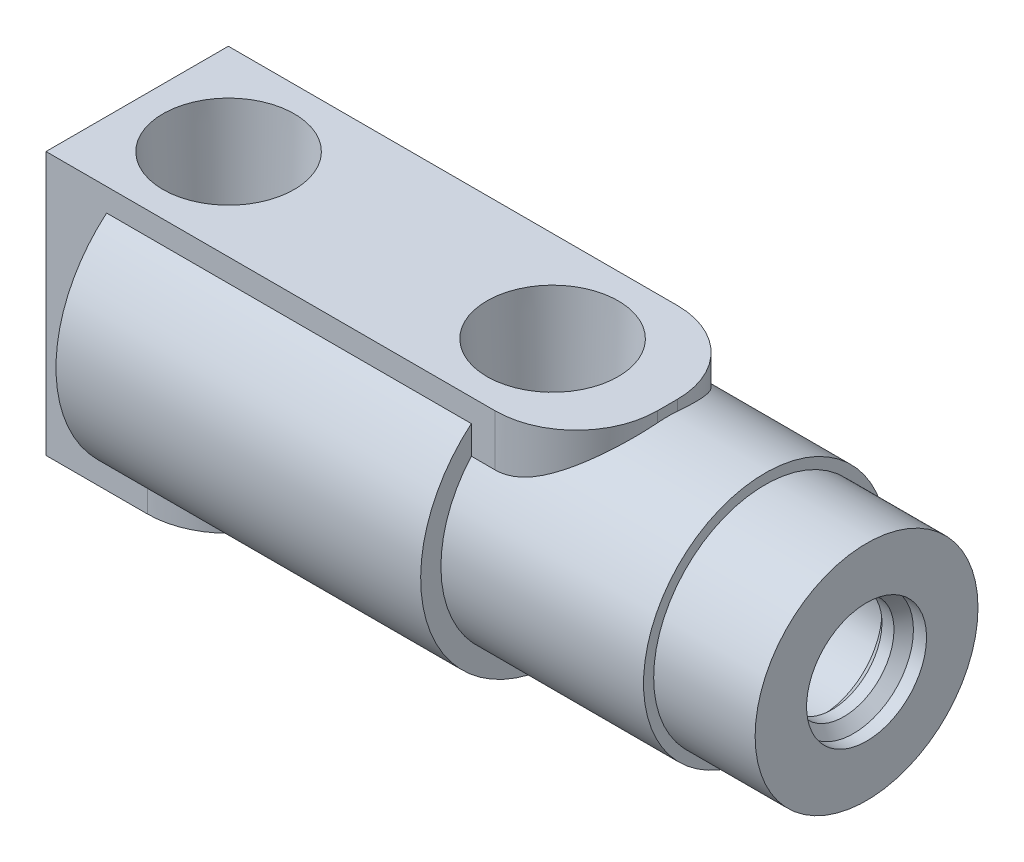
ISO-10303-21;
HEADER;
FILE_DESCRIPTION(('STEP AP214'),'2;1');
FILE_NAME('part.step','',(''),(''),'','','');
FILE_SCHEMA(('AUTOMOTIVE_DESIGN { 1 0 10303 214 1 1 1 1 }'));
ENDSEC;
DATA;
#1=APPLICATION_CONTEXT('core data for automotive mechanical design processes');
#2=APPLICATION_PROTOCOL_DEFINITION('international standard','automotive_design',2000,#1);
#3=PRODUCT_CONTEXT('',#1,'mechanical');
#4=PRODUCT('Part','Part','',(#3));
#5=PRODUCT_RELATED_PRODUCT_CATEGORY('part','',(#4));
#6=PRODUCT_DEFINITION_FORMATION('','',#4);
#7=PRODUCT_DEFINITION_CONTEXT('part definition',#1,'design');
#8=PRODUCT_DEFINITION('design','',#6,#7);
#9=PRODUCT_DEFINITION_SHAPE('','',#8);
#10=(LENGTH_UNIT() NAMED_UNIT(*) SI_UNIT(.MILLI.,.METRE.));
#11=(NAMED_UNIT(*) PLANE_ANGLE_UNIT() SI_UNIT($,.RADIAN.));
#12=(NAMED_UNIT(*) SI_UNIT($,.STERADIAN.) SOLID_ANGLE_UNIT());
#13=UNCERTAINTY_MEASURE_WITH_UNIT(LENGTH_MEASURE(1.E-05),#10,'distance_accuracy_value','');
#14=(GEOMETRIC_REPRESENTATION_CONTEXT(3) GLOBAL_UNCERTAINTY_ASSIGNED_CONTEXT((#13)) GLOBAL_UNIT_ASSIGNED_CONTEXT((#10,
#11,#12)) REPRESENTATION_CONTEXT('',''));
#15=CARTESIAN_POINT('',(0.,0.,0.));
#16=DIRECTION('',(0.,0.,1.));
#17=DIRECTION('',(1.,0.,0.));
#18=AXIS2_PLACEMENT_3D('',#15,#16,#17);
#19=CARTESIAN_POINT('',(-2.73059137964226,0.,0.));
#20=DIRECTION('',(1.,0.,0.));
#21=DIRECTION('',(0.,0.,-1.));
#22=AXIS2_PLACEMENT_3D('',#19,#20,#21);
#23=CYLINDRICAL_SURFACE('',#22,3.93612552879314);
#24=CARTESIAN_POINT('',(-1.79006737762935,0.,0.));
#25=DIRECTION('',(1.,0.,0.));
#26=DIRECTION('',(0.,1.,0.));
#27=AXIS2_PLACEMENT_3D('',#24,#25,#26);
#28=CIRCLE('',#27,3.93612552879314);
#29=CARTESIAN_POINT('',(-1.79006737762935,3.93612552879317,0.));
#30=VERTEX_POINT('',#29);
#31=EDGE_CURVE('E19',#30,#30,#28,.T.);
#32=ORIENTED_EDGE('',*,*,#31,.T.);
#33=EDGE_LOOP('',(#32));
#34=FACE_BOUND('',#33,.T.);
#35=CARTESIAN_POINT('',(-2.73059137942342,0.,0.));
#36=DIRECTION('',(-1.,0.,0.));
#37=DIRECTION('',(0.,0.,1.));
#38=AXIS2_PLACEMENT_3D('',#35,#36,#37);
#39=CIRCLE('',#38,3.93612552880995);
#40=CARTESIAN_POINT('',(-2.73059137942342,0.,3.93612552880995));
#41=VERTEX_POINT('',#40);
#42=EDGE_CURVE('E173',#41,#41,#39,.T.);
#43=ORIENTED_EDGE('',*,*,#42,.T.);
#44=EDGE_LOOP('',(#43));
#45=FACE_BOUND('',#44,.T.);
#46=ADVANCED_FACE('F16',(#34,#45),#23,.F.);
#47=CARTESIAN_POINT('',(-53.761159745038,-2.13360000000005,-2.17627200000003));
#48=DIRECTION('',(1.,0.,0.));
#49=DIRECTION('',(0.,0.,-1.));
#50=AXIS2_PLACEMENT_3D('',#47,#48,#49);
#51=PLANE('',#50);
#52=CARTESIAN_POINT('',(-53.761159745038,0.,0.));
#53=DIRECTION('',(-1.,0.,0.));
#54=DIRECTION('',(0.,0.,1.));
#55=AXIS2_PLACEMENT_3D('',#52,#53,#54);
#56=CIRCLE('',#55,2.13360000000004);
#57=CARTESIAN_POINT('',(-53.761159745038,0.,2.13359999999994));
#58=VERTEX_POINT('',#57);
#59=CARTESIAN_POINT('',(-53.761159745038,1.73462000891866E-08,-2.13360000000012));
#60=VERTEX_POINT('',#59);
#61=EDGE_CURVE('E163',#58,#60,#56,.F.);
#62=ORIENTED_EDGE('',*,*,#61,.T.);
#63=CARTESIAN_POINT('',(-53.761159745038,0.,0.));
#64=DIRECTION('',(-1.,0.,0.));
#65=DIRECTION('',(0.,0.,1.));
#66=AXIS2_PLACEMENT_3D('',#63,#64,#65);
#67=CIRCLE('',#66,2.13360000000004);
#68=EDGE_CURVE('E165',#60,#58,#67,.F.);
#69=ORIENTED_EDGE('',*,*,#68,.T.);
#70=EDGE_LOOP('',(#62,#69));
#71=FACE_BOUND('',#70,.T.);
#72=ADVANCED_FACE('F166',(#71),#51,.T.);
#73=CARTESIAN_POINT('',(-3.49346585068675,0.,0.));
#74=DIRECTION('',(-1.,0.,0.));
#75=DIRECTION('',(0.,0.,1.));
#76=AXIS2_PLACEMENT_3D('',#73,#74,#75);
#77=CONICAL_SURFACE('',#76,4.69900000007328,0.785398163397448);
#78=CARTESIAN_POINT('',(-3.49346585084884,0.,0.));
#79=DIRECTION('',(1.,0.,0.));
#80=DIRECTION('',(0.,0.,-1.));
#81=AXIS2_PLACEMENT_3D('',#78,#79,#80);
#82=CIRCLE('',#81,4.699);
#83=CARTESIAN_POINT('',(-3.49346585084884,0.,-4.699));
#84=VERTEX_POINT('',#83);
#85=EDGE_CURVE('E168',#84,#84,#82,.F.);
#86=ORIENTED_EDGE('',*,*,#85,.T.);
#87=EDGE_LOOP('',(#86));
#88=FACE_BOUND('',#87,.T.);
#89=ORIENTED_EDGE('',*,*,#42,.F.);
#90=EDGE_LOOP('',(#89));
#91=FACE_BOUND('',#90,.T.);
#92=ADVANCED_FACE('F881',(#88,#91),#77,.F.);
#93=CARTESIAN_POINT('',(-1.02719290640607,0.,0.));
#94=DIRECTION('',(1.,0.,0.));
#95=DIRECTION('',(0.,1.,0.));
#96=AXIS2_PLACEMENT_3D('',#93,#94,#95);
#97=CONICAL_SURFACE('',#96,4.69899999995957,0.785398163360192);
#98=ORIENTED_EDGE('',*,*,#31,.F.);
#99=EDGE_LOOP('',(#98));
#100=FACE_BOUND('',#99,.T.);
#101=CARTESIAN_POINT('',(-1.02719290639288,0.,0.));
#102=DIRECTION('',(1.,0.,0.));
#103=DIRECTION('',(0.,0.,-1.));
#104=AXIS2_PLACEMENT_3D('',#101,#102,#103);
#105=CIRCLE('',#104,4.69899999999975);
#106=CARTESIAN_POINT('',(-1.02719290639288,0.,-4.69899999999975));
#107=VERTEX_POINT('',#106);
#108=EDGE_CURVE('E183',#107,#107,#105,.T.);
#109=ORIENTED_EDGE('',*,*,#108,.T.);
#110=EDGE_LOOP('',(#109));
#111=FACE_BOUND('',#110,.T.);
#112=ADVANCED_FACE('F284',(#100,#111),#97,.F.);
#113=CARTESIAN_POINT('',(-49.9872,0.,0.));
#114=DIRECTION('',(-1.,0.,0.));
#115=DIRECTION('',(0.,0.,1.));
#116=AXIS2_PLACEMENT_3D('',#113,#114,#115);
#117=CYLINDRICAL_SURFACE('',#116,2.13360000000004);
#118=CARTESIAN_POINT('',(-49.9872000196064,4.3365428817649E-08,-2.13360000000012));
#119=CARTESIAN_POINT('',(-50.0501149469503,0.0629347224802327,-2.1336006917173));
#120=CARTESIAN_POINT('',(-50.1129755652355,0.125924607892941,-2.13081551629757));
#121=CARTESIAN_POINT('',(-50.229956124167,0.243109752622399,-2.12040583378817));
#122=CARTESIAN_POINT('',(-50.284105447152,0.297339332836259,-2.11348876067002));
#123=CARTESIAN_POINT('',(-50.3836756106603,0.39687689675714,-2.0968714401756));
#124=CARTESIAN_POINT('',(-50.4291331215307,0.44224987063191,-2.08777803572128));
#125=CARTESIAN_POINT('',(-50.5112883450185,0.524212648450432,-2.0685448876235));
#126=CARTESIAN_POINT('',(-50.5480423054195,0.560865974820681,-2.05891459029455));
#127=CARTESIAN_POINT('',(-50.6184142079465,0.63119234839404,-2.03840176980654));
#128=CARTESIAN_POINT('',(-50.6520594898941,0.664881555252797,-2.02766859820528));
#129=CARTESIAN_POINT('',(-50.7178647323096,0.730771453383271,-2.00484302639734));
#130=CARTESIAN_POINT('',(-50.7500352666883,0.762982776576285,-1.99281182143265));
#131=CARTESIAN_POINT('',(-50.8128765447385,0.82590137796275,-1.9675473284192));
#132=CARTESIAN_POINT('',(-50.8435592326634,0.856620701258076,-1.95437379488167));
#133=CARTESIAN_POINT('',(-50.9034273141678,0.916536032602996,-1.92698068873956));
#134=CARTESIAN_POINT('',(-50.9326255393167,0.945745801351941,-1.91281929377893));
#135=CARTESIAN_POINT('',(-50.9895228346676,1.00263805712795,-1.88359978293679));
#136=CARTESIAN_POINT('',(-51.0172359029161,1.03033562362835,-1.86859832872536));
#137=CARTESIAN_POINT('',(-51.0711616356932,1.08420875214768,-1.8378419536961));
#138=CARTESIAN_POINT('',(-51.0973895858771,1.1104005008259,-1.82214221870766));
#139=CARTESIAN_POINT('',(-51.148344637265,1.16127627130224,-1.7901260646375));
#140=CARTESIAN_POINT('',(-51.1730884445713,1.1859773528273,-1.77386341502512));
#141=CARTESIAN_POINT('',(-51.2210703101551,1.23389541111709,-1.74085041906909));
#142=CARTESIAN_POINT('',(-51.2443268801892,1.25713003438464,-1.72415254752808));
#143=CARTESIAN_POINT('',(-51.2998835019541,1.31267906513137,-1.68249059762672));
#144=CARTESIAN_POINT('',(-51.3319615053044,1.34479010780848,-1.65695536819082));
#145=CARTESIAN_POINT('',(-51.3941003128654,1.40700941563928,-1.60442424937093));
#146=CARTESIAN_POINT('',(-51.4241927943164,1.43714885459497,-1.57750277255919));
#147=CARTESIAN_POINT('',(-51.482356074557,1.49539747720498,-1.52236330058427));
#148=CARTESIAN_POINT('',(-51.5104608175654,1.5235408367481,-1.49421735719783));
#149=CARTESIAN_POINT('',(-51.5646469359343,1.57777782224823,-1.43679274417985));
#150=CARTESIAN_POINT('',(-51.5907645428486,1.60390851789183,-1.40758338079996));
#151=CARTESIAN_POINT('',(-51.6409740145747,1.65411381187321,-1.34819021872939));
#152=CARTESIAN_POINT('',(-51.6651045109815,1.67822805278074,-1.31807271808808));
#153=CARTESIAN_POINT('',(-51.7113368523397,1.7244041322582,-1.25701792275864));
#154=CARTESIAN_POINT('',(-51.7334798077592,1.74650790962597,-1.22614354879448));
#155=CARTESIAN_POINT('',(-51.7757363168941,1.78867934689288,-1.16372018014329));
#156=CARTESIAN_POINT('',(-51.795893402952,1.8087908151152,-1.13223051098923));
#157=CARTESIAN_POINT('',(-51.8248501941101,1.83769340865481,-1.08419057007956));
#158=CARTESIAN_POINT('',(-51.8341726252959,1.84700026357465,-1.06826142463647));
#159=CARTESIAN_POINT('',(-51.8523142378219,1.86512045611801,-1.03629451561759));
#160=CARTESIAN_POINT('',(-51.8611393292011,1.87393954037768,-1.02026337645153));
#161=CARTESIAN_POINT('',(-51.8801789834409,1.8929787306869,-0.984564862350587));
#162=CARTESIAN_POINT('',(-51.8903154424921,1.9031233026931,-0.964815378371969));
#163=CARTESIAN_POINT('',(-51.9099282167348,1.92276092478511,-0.925053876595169));
#164=CARTESIAN_POINT('',(-51.9194113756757,1.9322607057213,-0.905048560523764));
#165=CARTESIAN_POINT('',(-51.9377169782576,1.95060449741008,-0.864797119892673));
#166=CARTESIAN_POINT('',(-51.9465462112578,1.9594552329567,-0.844557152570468));
#167=CARTESIAN_POINT('',(-51.9635441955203,1.97649714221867,-0.803858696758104));
#168=CARTESIAN_POINT('',(-51.9717196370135,1.98469499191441,-0.783405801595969));
#169=CARTESIAN_POINT('',(-51.9874101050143,2.00042818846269,-0.742303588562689));
#170=CARTESIAN_POINT('',(-51.9949316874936,2.00797011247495,-0.721659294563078));
#171=CARTESIAN_POINT('',(-52.00931459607,2.02238925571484,-0.680196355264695));
#172=CARTESIAN_POINT('',(-52.0161823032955,2.02927290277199,-0.659382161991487));
#173=CARTESIAN_POINT('',(-52.029257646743,2.04237404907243,-0.617601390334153));
#174=CARTESIAN_POINT('',(-52.0354714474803,2.04859777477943,-0.596638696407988));
#175=CARTESIAN_POINT('',(-52.047239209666,2.06037837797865,-0.55458276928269));
#176=CARTESIAN_POINT('',(-52.0527990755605,2.06594122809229,-0.53349286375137));
#177=CARTESIAN_POINT('',(-52.0632592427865,2.07640011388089,-0.491204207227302));
#178=CARTESIAN_POINT('',(-52.0681651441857,2.08130181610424,-0.470008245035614));
#179=CARTESIAN_POINT('',(-52.0773177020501,2.09043916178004,-0.427528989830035));
#180=CARTESIAN_POINT('',(-52.0815696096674,2.09468011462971,-0.406247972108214));
#181=CARTESIAN_POINT('',(-52.0894145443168,2.10249742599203,-0.363619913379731));
#182=CARTESIAN_POINT('',(-52.0930124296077,2.10607868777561,-0.342274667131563));
#183=CARTESIAN_POINT('',(-52.0995497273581,2.11257877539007,-0.299539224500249));
#184=CARTESIAN_POINT('',(-52.1024935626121,2.11550205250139,-0.278150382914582));
#185=CARTESIAN_POINT('',(-52.107723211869,2.12068900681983,-0.235348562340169));
#186=CARTESIAN_POINT('',(-52.1100129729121,2.12295664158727,-0.213936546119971));
#187=CARTESIAN_POINT('',(-52.1139349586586,2.12683580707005,-0.171108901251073));
#188=CARTESIAN_POINT('',(-52.1155706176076,2.12845076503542,-0.14969389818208));
#189=CARTESIAN_POINT('',(-52.1181849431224,2.13102871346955,-0.106880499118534));
#190=CARTESIAN_POINT('',(-52.1191664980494,2.13199457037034,-0.0854824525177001));
#191=CARTESIAN_POINT('',(-52.1204731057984,2.13327907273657,-0.0427228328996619));
#192=CARTESIAN_POINT('',(-52.1208004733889,2.1336000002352,-0.0213613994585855));
#193=CARTESIAN_POINT('',(-52.1207995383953,2.13359999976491,0.0213653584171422));
#194=CARTESIAN_POINT('',(-52.1204711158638,2.13327895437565,0.0427306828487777));
#195=CARTESIAN_POINT('',(-52.1191626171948,2.13199399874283,0.0854975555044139));
#196=CARTESIAN_POINT('',(-52.118180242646,2.13102782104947,0.106898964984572));
#197=CARTESIAN_POINT('',(-52.1155643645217,2.12844905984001,0.149718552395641));
#198=CARTESIAN_POINT('',(-52.1139279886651,2.12683362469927,0.171136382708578));
#199=CARTESIAN_POINT('',(-52.110004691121,2.12295338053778,0.213969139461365));
#200=CARTESIAN_POINT('',(-52.1077143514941,2.12068515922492,0.235383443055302));
#201=CARTESIAN_POINT('',(-52.102483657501,2.11549695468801,0.278189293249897));
#202=CARTESIAN_POINT('',(-52.0995393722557,2.11257302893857,0.299579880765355));
#203=CARTESIAN_POINT('',(-52.0930012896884,2.10607161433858,0.342318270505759));
#204=CARTESIAN_POINT('',(-52.0894030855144,2.10248968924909,0.363664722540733));
#205=CARTESIAN_POINT('',(-52.0815576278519,2.09467106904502,0.406294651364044));
#206=CARTESIAN_POINT('',(-52.0773055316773,2.09042948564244,0.427576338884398));
#207=CARTESIAN_POINT('',(-52.068152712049,2.08129094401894,0.470056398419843));
#208=CARTESIAN_POINT('',(-52.0632467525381,2.07638869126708,0.491252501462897));
#209=CARTESIAN_POINT('',(-52.0527865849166,2.06592881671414,0.53354091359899));
#210=CARTESIAN_POINT('',(-52.047226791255,2.06036554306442,0.554630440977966));
#211=CARTESIAN_POINT('',(-52.035459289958,2.04858425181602,0.596685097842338));
#212=CARTESIAN_POINT('',(-52.0292456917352,2.04236027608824,0.617646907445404));
#213=CARTESIAN_POINT('',(-52.0161708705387,2.02925883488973,0.659425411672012));
#214=CARTESIAN_POINT('',(-52.0093034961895,2.02237515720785,0.680238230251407));
#215=CARTESIAN_POINT('',(-51.9949213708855,2.00795620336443,0.721697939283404));
#216=CARTESIAN_POINT('',(-51.9874002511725,2.00041451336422,0.742340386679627));
#217=CARTESIAN_POINT('',(-51.9717108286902,1.98468207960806,0.783438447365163));
#218=CARTESIAN_POINT('',(-51.9635359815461,1.97648477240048,0.803889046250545));
#219=CARTESIAN_POINT('',(-51.9465393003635,1.95944428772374,0.844582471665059));
#220=CARTESIAN_POINT('',(-51.9377107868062,1.95059444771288,0.864819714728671));
#221=CARTESIAN_POINT('',(-51.9194067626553,1.93225282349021,0.905065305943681));
#222=CARTESIAN_POINT('',(-51.9099244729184,1.92275432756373,0.925067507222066));
#223=CARTESIAN_POINT('',(-51.890313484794,1.90311971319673,0.9648223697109));
#224=CARTESIAN_POINT('',(-51.8801779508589,1.89297687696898,0.98456833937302));
#225=CARTESIAN_POINT('',(-51.8611369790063,1.87393784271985,1.02026655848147));
#226=CARTESIAN_POINT('',(-51.8523094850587,1.86511702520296,1.0363007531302));
#227=CARTESIAN_POINT('',(-51.8341634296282,1.84699343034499,1.06827329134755));
#228=CARTESIAN_POINT('',(-51.8248389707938,1.83768491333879,1.08420502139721));
#229=CARTESIAN_POINT('',(-51.795876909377,1.80877788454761,1.13225132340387));
#230=CARTESIAN_POINT('',(-51.7757167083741,1.78866347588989,1.16374472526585));
#231=CARTESIAN_POINT('',(-51.7334551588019,1.74648683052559,1.22617365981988));
#232=CARTESIAN_POINT('',(-51.711310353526,1.72438084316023,1.25704995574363));
#233=CARTESIAN_POINT('',(-51.6650754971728,1.67820127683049,1.31810683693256));
#234=CARTESIAN_POINT('',(-51.6409444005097,1.6540858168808,1.3482245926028));
#235=CARTESIAN_POINT('',(-51.5907349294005,1.60387926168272,1.40761668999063));
#236=CARTESIAN_POINT('',(-51.5646179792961,1.57774858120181,1.43682482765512));
#237=CARTESIAN_POINT('',(-51.5104343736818,1.52351304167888,1.4942456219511));
#238=CARTESIAN_POINT('',(-51.4823315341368,1.49537116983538,1.52238906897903));
#239=CARTESIAN_POINT('',(-51.4241733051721,1.43712712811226,1.57752244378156));
#240=CARTESIAN_POINT('',(-51.3940840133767,1.4069908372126,1.60444042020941));
#241=CARTESIAN_POINT('',(-51.3319526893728,1.34477971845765,1.65696363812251));
#242=CARTESIAN_POINT('',(-51.2998790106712,1.31267377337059,1.68249456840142));
#243=CARTESIAN_POINT('',(-51.2443220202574,1.25712567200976,1.72415581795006));
#244=CARTESIAN_POINT('',(-51.2210605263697,1.23388666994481,1.74085670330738));
#245=CARTESIAN_POINT('',(-51.173070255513,1.18596083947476,1.77387451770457));
#246=CARTESIAN_POINT('',(-51.1483230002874,1.16125637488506,1.79013903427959));
#247=CARTESIAN_POINT('',(-51.0973623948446,1.11037500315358,1.82215779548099));
#248=CARTESIAN_POINT('',(-51.0711323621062,1.08418105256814,1.83785833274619));
#249=CARTESIAN_POINT('',(-51.0172038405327,1.03030477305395,1.86861535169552));
#250=CARTESIAN_POINT('',(-50.9894900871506,1.00260627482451,1.88361671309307));
#251=CARTESIAN_POINT('',(-50.9325927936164,0.94571351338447,1.91283524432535));
#252=CARTESIAN_POINT('',(-50.9033952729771,0.916504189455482,1.9269958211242));
#253=CARTESIAN_POINT('',(-50.8435299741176,0.856591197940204,1.95438668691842));
#254=CARTESIAN_POINT('',(-50.8128493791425,0.825873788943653,1.96755887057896));
#255=CARTESIAN_POINT('',(-50.7500136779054,0.762960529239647,1.99282027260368));
#256=CARTESIAN_POINT('',(-50.7178466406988,0.730752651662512,2.00484981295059));
#257=CARTESIAN_POINT('',(-50.6520497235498,0.664871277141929,2.0276718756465));
#258=CARTESIAN_POINT('',(-50.6184092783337,0.631187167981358,2.03840328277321));
#259=CARTESIAN_POINT('',(-50.5480372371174,0.560861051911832,2.05891602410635));
#260=CARTESIAN_POINT('',(-50.5112782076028,0.524202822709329,2.06854747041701));
#261=CARTESIAN_POINT('',(-50.4291162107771,0.442233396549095,2.08778156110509));
#262=CARTESIAN_POINT('',(-50.3836570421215,0.396858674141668,2.09687492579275));
#263=CARTESIAN_POINT('',(-50.2840868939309,0.297320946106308,2.11349130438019));
#264=CARTESIAN_POINT('',(-50.2299392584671,0.243092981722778,2.12040771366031));
#265=CARTESIAN_POINT('',(-50.112965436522,0.125914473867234,2.13081596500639));
#266=CARTESIAN_POINT('',(-50.0501098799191,0.0629296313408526,2.13360069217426));
#267=CARTESIAN_POINT('',(-49.9872000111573,0.,2.13359999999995));
#268=B_SPLINE_CURVE_WITH_KNOTS('',3,(#118,#119,#120,#121,#122,#123,#124,#125,#126,#127,#128,
#129,#130,#131,#132,#133,#134,#135,#136,#137,#138,#139,#140,#141,#142,#143,#144,#145,#146,#147,
#148,#149,#150,#151,#152,#153,#154,#155,#156,#157,#158,#159,#160,#161,#162,#163,#164,#165,#166,
#167,#168,#169,#170,#171,#172,#173,#174,#175,#176,#177,#178,#179,#180,#181,#182,#183,#184,#185,
#186,#187,#188,#189,#190,#191,#192,#193,#194,#195,#196,#197,#198,#199,#200,#201,#202,#203,#204,
#205,#206,#207,#208,#209,#210,#211,#212,#213,#214,#215,#216,#217,#218,#219,#220,#221,#222,#223,
#224,#225,#226,#227,#228,#229,#230,#231,#232,#233,#234,#235,#236,#237,#238,#239,#240,#241,#242,
#243,#244,#245,#246,#247,#248,#249,#250,#251,#252,#253,#254,#255,#256,#257,#258,#259,#260,#261,
#262,#263,#264,#265,#266,#267),.UNSPECIFIED.,.F.,.F.,(4,2,2,2,2,2,2,2,2,2,2,2,2,2,2,2,2,2,2,2,2,
2,2,2,2,2,2,2,2,2,2,2,2,2,2,2,2,2,2,2,2,2,2,2,2,2,2,2,2,2,2,2,2,2,2,2,2,2,2,2,2,2,2,2,2,2,2,2,2,
2,2,2,2,2,4),(0.,0.266921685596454,0.497648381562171,0.69217959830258,0.850517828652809,
0.996906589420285,1.13813889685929,1.27422641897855,1.40518220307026,1.53102089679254,
1.65175901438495,1.76741525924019,1.87801091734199,2.0341752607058,2.18526578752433,
2.33137282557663,2.47259626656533,2.60904672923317,2.74084685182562,2.86813271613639,
2.93013608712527,2.99106888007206,3.06427298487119,3.13653005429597,3.20788183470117,
3.27837168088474,3.3480445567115,3.41694702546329,3.48512722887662,3.55263485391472,
3.619521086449,3.68583855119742,3.7516412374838,3.8169844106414,3.88192450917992,
3.94651902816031,4.0108263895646,4.0749058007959,4.13899693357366,4.20331452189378,
4.2679177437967,4.3328649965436,4.39821375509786,4.46402044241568,4.53034031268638,
4.59722734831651,4.66473417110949,4.7329119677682,4.8018104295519,4.87147770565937,
4.94196036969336,5.01330339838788,5.08555016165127,5.15874242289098,5.21968783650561,
5.28170217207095,5.40900495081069,5.54081524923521,5.67726910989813,5.81848915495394,
5.96458600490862,6.11565956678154,6.27180019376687,6.3824175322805,6.4980892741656,
6.6188366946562,6.74467849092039,6.87563117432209,7.01170939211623,7.15292619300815,
7.2992932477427,7.45765288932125,7.65219123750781,7.88291078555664,8.14981104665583),.UNSPECIFIED.);
#269=CARTESIAN_POINT('',(-49.9872000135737,4.33654324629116E-08,-2.13360000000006));
#270=VERTEX_POINT('',#269);
#271=CARTESIAN_POINT('',(-49.987200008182,-1.09440688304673E-08,2.13359999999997));
#272=VERTEX_POINT('',#271);
#273=EDGE_CURVE('E225',#270,#272,#268,.T.);
#274=ORIENTED_EDGE('',*,*,#273,.T.);
#275=CARTESIAN_POINT('',(-49.9872000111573,0.,2.13359999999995));
#276=CARTESIAN_POINT('',(-50.0501146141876,-0.0629343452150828,2.13360069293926));
#277=CARTESIAN_POINT('',(-50.1129749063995,-0.125923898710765,2.13081554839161));
#278=CARTESIAN_POINT('',(-50.2299550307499,-0.243108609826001,2.12040596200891));
#279=CARTESIAN_POINT('',(-50.2841042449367,-0.297338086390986,2.11348893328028));
#280=CARTESIAN_POINT('',(-50.3836744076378,-0.396875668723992,2.09687167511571));
#281=CARTESIAN_POINT('',(-50.4291320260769,-0.442248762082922,2.08777827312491));
#282=CARTESIAN_POINT('',(-50.5112876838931,-0.524211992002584,2.06854506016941));
#283=CARTESIAN_POINT('',(-50.5480419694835,-0.560865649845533,2.05891468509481));
#284=CARTESIAN_POINT('',(-50.6184141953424,-0.631192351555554,2.03840176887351));
#285=CARTESIAN_POINT('',(-50.6520594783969,-0.664881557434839,2.02766859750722));
#286=CARTESIAN_POINT('',(-50.7178647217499,-0.73077145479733,2.00484302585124));
#287=CARTESIAN_POINT('',(-50.7500352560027,-0.762982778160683,1.99281182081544));
#288=CARTESIAN_POINT('',(-50.8128765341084,-0.825901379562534,1.96754732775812));
#289=CARTESIAN_POINT('',(-50.8435592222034,-0.856620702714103,1.95437379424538));
#290=CARTESIAN_POINT('',(-50.9034273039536,-0.916536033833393,1.9269806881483));
#291=CARTESIAN_POINT('',(-50.9326255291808,-0.945745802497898,1.91281929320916));
#292=CARTESIAN_POINT('',(-50.9895228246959,-1.00263805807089,1.88359978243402));
#293=CARTESIAN_POINT('',(-51.0172358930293,-1.03033562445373,1.86859832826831));
#294=CARTESIAN_POINT('',(-51.0711616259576,-1.08420875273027,1.83784195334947));
#295=CARTESIAN_POINT('',(-51.097389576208,-1.1104005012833,1.82214221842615));
#296=CARTESIAN_POINT('',(-51.148344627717,-1.16127627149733,1.7901260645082));
#297=CARTESIAN_POINT('',(-51.1730884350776,-1.1859773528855,1.77386341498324));
#298=CARTESIAN_POINT('',(-51.221070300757,-1.23389541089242,1.74085041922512));
#299=CARTESIAN_POINT('',(-51.2443268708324,-1.25713003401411,1.72415254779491));
#300=CARTESIAN_POINT('',(-51.2998834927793,-1.31267906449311,1.68249059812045));
#301=CARTESIAN_POINT('',(-51.3319614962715,-1.34479010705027,1.65695536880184));
#302=CARTESIAN_POINT('',(-51.394100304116,-1.40700941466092,1.60442425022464));
#303=CARTESIAN_POINT('',(-51.4241927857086,-1.4371488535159,1.57750277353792));
#304=CARTESIAN_POINT('',(-51.4823560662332,-1.4953974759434,1.52236330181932));
#305=CARTESIAN_POINT('',(-51.510460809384,-1.52354083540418,1.49421735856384));
#306=CARTESIAN_POINT('',(-51.5646469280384,-1.57777782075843,1.43679274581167));
#307=CARTESIAN_POINT('',(-51.5907645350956,-1.60390851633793,1.40758338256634));
#308=CARTESIAN_POINT('',(-51.6409740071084,-1.65411381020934,1.34819022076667));
#309=CARTESIAN_POINT('',(-51.6651045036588,-1.67822805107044,1.31807272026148));
#310=CARTESIAN_POINT('',(-51.711336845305,-1.72440413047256,1.25701792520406));
#311=CARTESIAN_POINT('',(-51.7334798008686,-1.74650790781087,1.22614355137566));
#312=CARTESIAN_POINT('',(-51.7757363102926,-1.78867934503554,1.16372018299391));
#313=CARTESIAN_POINT('',(-51.7958933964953,-1.80879081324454,1.13223051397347));
#314=CARTESIAN_POINT('',(-51.8248501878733,-1.83769340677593,1.08419057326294));
#315=CARTESIAN_POINT('',(-51.8341726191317,-1.84700026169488,1.06826142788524));
#316=CARTESIAN_POINT('',(-51.8523142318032,-1.86512045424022,1.03629451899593));
#317=CARTESIAN_POINT('',(-51.8611393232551,-1.87393953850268,1.02026337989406));
#318=CARTESIAN_POINT('',(-51.8801789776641,-1.89297872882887,0.984564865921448));
#319=CARTESIAN_POINT('',(-51.890315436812,-1.90312330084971,0.964815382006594));
#320=CARTESIAN_POINT('',(-51.9099282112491,-1.92276092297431,0.925053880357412));
#321=CARTESIAN_POINT('',(-51.9194113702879,-1.93226070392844,0.905048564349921));
#322=CARTESIAN_POINT('',(-51.9377169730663,-1.95060449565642,0.864797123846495));
#323=CARTESIAN_POINT('',(-51.9465462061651,-1.95945523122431,0.844557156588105));
#324=CARTESIAN_POINT('',(-51.963544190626,-1.97649714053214,0.803858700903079));
#325=CARTESIAN_POINT('',(-51.9717196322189,-1.98469499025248,0.783405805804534));
#326=CARTESIAN_POINT('',(-51.98741010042,-2.00042818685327,0.742303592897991));
#327=CARTESIAN_POINT('',(-51.9949316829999,-2.00797011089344,0.721659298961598));
#328=CARTESIAN_POINT('',(-52.0093145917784,-2.02238925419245,0.680196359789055));
#329=CARTESIAN_POINT('',(-52.0161822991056,-2.02927290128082,0.659382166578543));
#330=CARTESIAN_POINT('',(-52.0292576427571,-2.04237404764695,0.617601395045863));
#331=CARTESIAN_POINT('',(-52.035471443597,-2.04859777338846,0.596638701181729));
#332=CARTESIAN_POINT('',(-52.0472392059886,-2.06037837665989,0.554582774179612));
#333=CARTESIAN_POINT('',(-52.0527990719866,-2.0659412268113,0.533492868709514));
#334=CARTESIAN_POINT('',(-52.0632592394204,-2.07640011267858,0.491204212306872));
#335=CARTESIAN_POINT('',(-52.0681651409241,-2.08130181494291,0.470008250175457));
#336=CARTESIAN_POINT('',(-52.0773176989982,-2.09043916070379,0.427528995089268));
#337=CARTESIAN_POINT('',(-52.0815696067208,-2.09468011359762,0.406247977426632));
#338=CARTESIAN_POINT('',(-52.0894145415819,-2.10249742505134,0.363619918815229));
#339=CARTESIAN_POINT('',(-52.0930124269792,-2.10607868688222,0.34227467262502));
#340=CARTESIAN_POINT('',(-52.0995497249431,-2.11257877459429,0.299539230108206));
#341=CARTESIAN_POINT('',(-52.1024935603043,-2.115502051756,0.278150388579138));
#342=CARTESIAN_POINT('',(-52.1077232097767,-2.12068900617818,0.235348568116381));
#343=CARTESIAN_POINT('',(-52.1100129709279,-2.12295664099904,0.21393655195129));
#344=CARTESIAN_POINT('',(-52.1139349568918,-2.12683580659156,0.171108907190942));
#345=CARTESIAN_POINT('',(-52.1155706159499,-2.12845076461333,0.149693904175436));
#346=CARTESIAN_POINT('',(-52.1181849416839,-2.13102871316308,0.106880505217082));
#347=CARTESIAN_POINT('',(-52.1191664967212,-2.13199457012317,0.085482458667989));
#348=CARTESIAN_POINT('',(-52.120473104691,-2.13327907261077,0.04272283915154));
#349=CARTESIAN_POINT('',(-52.1208004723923,-2.13360000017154,0.021361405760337));
#350=CARTESIAN_POINT('',(-52.1207995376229,-2.1335999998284,-0.0213653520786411));
#351=CARTESIAN_POINT('',(-52.1204711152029,-2.13327895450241,-0.0427306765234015));
#352=CARTESIAN_POINT('',(-52.1191626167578,-2.13199399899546,-0.0854975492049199));
#353=CARTESIAN_POINT('',(-52.1181802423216,-2.13102782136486,-0.106898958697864));
#354=CARTESIAN_POINT('',(-52.1155643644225,-2.12844906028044,-0.149718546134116));
#355=CARTESIAN_POINT('',(-52.1139279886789,-2.12683362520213,-0.171136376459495));
#356=CARTESIAN_POINT('',(-52.1100046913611,-2.12295338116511,-0.213969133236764));
#357=CARTESIAN_POINT('',(-52.1077143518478,-2.12068515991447,-0.235383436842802));
#358=CARTESIAN_POINT('',(-52.1024836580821,-2.11549695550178,-0.2781892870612));
#359=CARTESIAN_POINT('',(-52.0995393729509,-2.11257302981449,-0.299579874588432));
#360=CARTESIAN_POINT('',(-52.0930012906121,-2.10607161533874,-0.342318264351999));
#361=CARTESIAN_POINT('',(-52.0894030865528,-2.10248969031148,-0.363664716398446));
#362=CARTESIAN_POINT('',(-52.0815576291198,-2.09467107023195,-0.406294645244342));
#363=CARTESIAN_POINT('',(-52.0773055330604,-2.09042948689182,-0.427576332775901));
#364=CARTESIAN_POINT('',(-52.0681527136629,-2.08129094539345,-0.470056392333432));
#365=CARTESIAN_POINT('',(-52.0632467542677,-2.0763886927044,-0.49125249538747));
#366=CARTESIAN_POINT('',(-52.052786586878,-2.06592881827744,-0.533540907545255));
#367=CARTESIAN_POINT('',(-52.0472267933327,-2.06036554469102,-0.554630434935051));
#368=CARTESIAN_POINT('',(-52.0354592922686,-2.04858425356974,-0.596685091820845));
#369=CARTESIAN_POINT('',(-52.0292456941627,-2.0423602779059,-0.61764690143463));
#370=CARTESIAN_POINT('',(-52.0161708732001,-2.02925883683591,-0.659425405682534));
#371=CARTESIAN_POINT('',(-52.0093034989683,-2.02237515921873,-0.680238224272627));
#372=CARTESIAN_POINT('',(-51.9949213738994,-2.00795620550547,-0.72169793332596));
#373=CARTESIAN_POINT('',(-51.9874002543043,-2.00041451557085,-0.742340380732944));
#374=CARTESIAN_POINT('',(-51.9717108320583,-1.98468208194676,-0.783438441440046));
#375=CARTESIAN_POINT('',(-51.9635359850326,-1.97648477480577,-0.80388904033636));
#376=CARTESIAN_POINT('',(-51.9465393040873,-1.95944429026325,-0.844582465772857));
#377=CARTESIAN_POINT('',(-51.9377107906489,-1.95059445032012,-0.864819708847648));
#378=CARTESIAN_POINT('',(-51.9194067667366,-1.932252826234,-0.905065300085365));
#379=CARTESIAN_POINT('',(-51.9099244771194,-1.92275433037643,-0.925067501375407));
#380=CARTESIAN_POINT('',(-51.8903134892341,-1.9031197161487,-0.964822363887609));
#381=CARTESIAN_POINT('',(-51.8801779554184,-1.89297687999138,-0.984568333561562));
#382=CARTESIAN_POINT('',(-51.8611369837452,-1.87393784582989,-1.02026655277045));
#383=CARTESIAN_POINT('',(-51.8523094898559,-1.86511702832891,-1.03630074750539));
#384=CARTESIAN_POINT('',(-51.8341634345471,-1.84699343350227,-1.06827328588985));
#385=CARTESIAN_POINT('',(-51.824838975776,-1.83768491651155,-1.0842050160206));
#386=CARTESIAN_POINT('',(-51.7958769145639,-1.80877788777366,-1.13225131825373));
#387=CARTESIAN_POINT('',(-51.7757167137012,-1.78866347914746,-1.16374472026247));
#388=CARTESIAN_POINT('',(-51.7334551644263,-1.74648683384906,-1.22617365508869));
#389=CARTESIAN_POINT('',(-51.7113103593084,-1.72438084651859,-1.2570499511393));
#390=CARTESIAN_POINT('',(-51.6650755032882,-1.67820128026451,-1.31810683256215));
#391=CARTESIAN_POINT('',(-51.6409444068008,-1.65408582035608,-1.34822458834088));
#392=CARTESIAN_POINT('',(-51.59073493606,-1.60387926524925,-1.40761668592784));
#393=CARTESIAN_POINT('',(-51.5646179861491,-1.57774858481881,-1.4368248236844));
#394=CARTESIAN_POINT('',(-51.5104343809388,-1.52351304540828,-1.49424561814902));
#395=CARTESIAN_POINT('',(-51.482331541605,-1.49537117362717,-1.5223890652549));
#396=CARTESIAN_POINT('',(-51.4241733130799,-1.43712713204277,-1.5775224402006));
#397=CARTESIAN_POINT('',(-51.3940840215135,-1.40699084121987,-1.60444041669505));
#398=CARTESIAN_POINT('',(-51.3319526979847,-1.34477972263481,-1.65696363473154));
#399=CARTESIAN_POINT('',(-51.2998790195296,-1.3126737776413,-1.68249456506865));
#400=CARTESIAN_POINT('',(-51.2443220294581,-1.25712567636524,-1.72415581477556));
#401=CARTESIAN_POINT('',(-51.2210605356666,-1.23388667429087,-1.74085670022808));
#402=CARTESIAN_POINT('',(-51.1730702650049,-1.18596084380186,-1.77387451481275));
#403=CARTESIAN_POINT('',(-51.148323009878,-1.16125637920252,-1.79013903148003));
#404=CARTESIAN_POINT('',(-51.0973624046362,-1.11037500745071,-1.82215779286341));
#405=CARTESIAN_POINT('',(-51.0711323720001,-1.08418105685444,-1.83785833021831));
#406=CARTESIAN_POINT('',(-51.0172038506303,-1.03030477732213,-1.86861534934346));
#407=CARTESIAN_POINT('',(-50.9894900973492,-1.00260627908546,-1.88361671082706));
#408=CARTESIAN_POINT('',(-50.9325928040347,-0.945713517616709,-1.91283524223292));
#409=CARTESIAN_POINT('',(-50.9033952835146,-0.916504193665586,-1.92699581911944));
#410=CARTESIAN_POINT('',(-50.8435299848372,-0.856591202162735,-1.95438668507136));
#411=CARTESIAN_POINT('',(-50.8128493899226,-0.825873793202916,-1.96755886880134));
#412=CARTESIAN_POINT('',(-50.7500136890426,-0.762960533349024,-1.99282027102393));
#413=CARTESIAN_POINT('',(-50.7178466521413,-0.730752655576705,-2.00484981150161));
#414=CARTESIAN_POINT('',(-50.6520497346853,-0.664871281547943,-2.02767187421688));
#415=CARTESIAN_POINT('',(-50.6184092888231,-0.631187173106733,-2.03840328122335));
#416=CARTESIAN_POINT('',(-50.5480369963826,-0.560860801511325,-2.05891609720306));
#417=CARTESIAN_POINT('',(-50.5112777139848,-0.524202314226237,-2.06854760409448));
#418=CARTESIAN_POINT('',(-50.4291153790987,-0.442232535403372,-2.08778174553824));
#419=CARTESIAN_POINT('',(-50.3836561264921,-0.396857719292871,-2.09687510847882));
#420=CARTESIAN_POINT('',(-50.2840859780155,-0.297319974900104,-2.11349143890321));
#421=CARTESIAN_POINT('',(-50.2299384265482,-0.24309208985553,-2.12040781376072));
#422=CARTESIAN_POINT('',(-50.1129649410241,-0.125913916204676,-2.13081599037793));
#423=CARTESIAN_POINT('',(-50.0501096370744,-0.0629293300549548,-2.13360069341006));
#424=CARTESIAN_POINT('',(-49.9872000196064,4.3365428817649E-08,-2.13360000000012));
#425=B_SPLINE_CURVE_WITH_KNOTS('',3,(#275,#276,#277,#278,#279,#280,#281,#282,#283,#284,#285,
#286,#287,#288,#289,#290,#291,#292,#293,#294,#295,#296,#297,#298,#299,#300,#301,#302,#303,#304,
#305,#306,#307,#308,#309,#310,#311,#312,#313,#314,#315,#316,#317,#318,#319,#320,#321,#322,#323,
#324,#325,#326,#327,#328,#329,#330,#331,#332,#333,#334,#335,#336,#337,#338,#339,#340,#341,#342,
#343,#344,#345,#346,#347,#348,#349,#350,#351,#352,#353,#354,#355,#356,#357,#358,#359,#360,#361,
#362,#363,#364,#365,#366,#367,#368,#369,#370,#371,#372,#373,#374,#375,#376,#377,#378,#379,#380,
#381,#382,#383,#384,#385,#386,#387,#388,#389,#390,#391,#392,#393,#394,#395,#396,#397,#398,#399,
#400,#401,#402,#403,#404,#405,#406,#407,#408,#409,#410,#411,#412,#413,#414,#415,#416,#417,#418,
#419,#420,#421,#422,#423,#424),.UNSPECIFIED.,.F.,.F.,(4,2,2,2,2,2,2,2,2,2,2,2,2,2,2,2,2,2,2,2,2,
2,2,2,2,2,2,2,2,2,2,2,2,2,2,2,2,2,2,2,2,2,2,2,2,2,2,2,2,2,2,2,2,2,2,2,2,2,2,2,2,2,2,2,2,2,2,2,2,
2,2,2,2,2,4),(0.,0.266920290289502,0.497646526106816,0.692178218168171,0.850517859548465,
0.996906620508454,1.13813892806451,1.27422645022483,1.40518223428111,1.53102092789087,
1.65175904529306,1.76741528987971,1.87801094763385,2.0341752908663,2.18526581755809,
2.33137285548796,2.47259629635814,2.60904675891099,2.7408468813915,2.86813274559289,
2.93013611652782,2.99106890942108,3.06427301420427,3.13653008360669,3.2078818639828,
3.27837171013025,3.34804458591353,3.4169470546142,3.48512725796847,3.55263488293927,
3.61952111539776,3.68583858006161,3.75164126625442,3.8169844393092,3.88192453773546,
3.94651905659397,4.01082641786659,4.07490582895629,4.1389969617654,4.20331455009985,
4.26791777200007,4.33286502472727,4.39821378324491,4.46402047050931,4.53034034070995,
4.59722737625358,4.66473419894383,4.73291199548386,4.80181045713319,4.87147773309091,
4.9419603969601,5.0133034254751,5.08555018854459,5.15874244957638,5.21968786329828,
5.2817021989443,5.40900497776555,5.54081527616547,5.67726913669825,5.81848918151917,
5.96458603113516,6.11565959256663,6.27180021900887,6.38241755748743,6.49808929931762,
6.61883671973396,6.74467851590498,6.87563119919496,7.01170941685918,7.1529262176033,
7.29929327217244,7.45765401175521,7.65219273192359,7.8829119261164,8.14981110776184),.UNSPECIFIED.);
#426=EDGE_CURVE('E270',#272,#270,#425,.T.);
#427=ORIENTED_EDGE('',*,*,#426,.T.);
#428=EDGE_LOOP('',(#274,#427));
#429=FACE_BOUND('',#428,.T.);
#430=ORIENTED_EDGE('',*,*,#61,.F.);
#431=ORIENTED_EDGE('',*,*,#68,.F.);
#432=EDGE_LOOP('',(#430,#431));
#433=FACE_BOUND('',#432,.T.);
#434=ADVANCED_FACE('F170',(#429,#433),#117,.F.);
#435=CARTESIAN_POINT('',(-36.2986597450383,0.,0.));
#436=DIRECTION('',(-1.,0.,0.));
#437=DIRECTION('',(0.,0.,1.));
#438=AXIS2_PLACEMENT_3D('',#435,#436,#437);
#439=CYLINDRICAL_SURFACE('',#438,2.13360000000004);
#440=CARTESIAN_POINT('',(-49.9872000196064,4.3365428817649E-08,-2.13360000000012));
#441=CARTESIAN_POINT('',(-49.9440547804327,-0.0431476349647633,-2.13360061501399));
#442=CARTESIAN_POINT('',(-49.9009531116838,-0.0863393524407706,-2.13229114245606));
#443=CARTESIAN_POINT('',(-49.8177218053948,-0.169809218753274,-2.12721494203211));
#444=CARTESIAN_POINT('',(-49.7775848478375,-0.210090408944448,-2.12361713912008));
#445=CARTESIAN_POINT('',(-49.7002821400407,-0.287642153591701,-2.11445628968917));
#446=CARTESIAN_POINT('',(-49.663108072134,-0.324923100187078,-2.10905119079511));
#447=CARTESIAN_POINT('',(-49.5917329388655,-0.396427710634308,-2.09673734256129));
#448=CARTESIAN_POINT('',(-49.5575221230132,-0.430666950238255,-2.08997536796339));
#449=CARTESIAN_POINT('',(-49.4920744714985,-0.496080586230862,-2.07537494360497));
#450=CARTESIAN_POINT('',(-49.4608261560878,-0.527273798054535,-2.06767216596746));
#451=CARTESIAN_POINT('',(-49.4013070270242,-0.586621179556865,-2.05158047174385));
#452=CARTESIAN_POINT('',(-49.3730222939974,-0.614795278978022,-2.04331643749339));
#453=CARTESIAN_POINT('',(-49.3194279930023,-0.668149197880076,-2.02645724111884));
#454=CARTESIAN_POINT('',(-49.2941019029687,-0.693348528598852,-2.01797645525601));
#455=CARTESIAN_POINT('',(-49.2464440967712,-0.740831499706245,-2.00099507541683));
#456=CARTESIAN_POINT('',(-49.2240899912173,-0.76313039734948,-1.9925996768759));
#457=CARTESIAN_POINT('',(-49.1651909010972,-0.821975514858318,-1.96930306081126));
#458=CARTESIAN_POINT('',(-49.1288122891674,-0.858414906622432,-1.95370408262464));
#459=CARTESIAN_POINT('',(-49.0578400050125,-0.929499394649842,-1.9208746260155));
#460=CARTESIAN_POINT('',(-49.0232286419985,-0.964162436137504,-1.90372113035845));
#461=CARTESIAN_POINT('',(-48.9558126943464,-1.03167767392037,-1.86796551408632));
#462=CARTESIAN_POINT('',(-48.922988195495,-1.06454986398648,-1.84943882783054));
#463=CARTESIAN_POINT('',(-48.8591424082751,-1.12845712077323,-1.81112372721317));
#464=CARTESIAN_POINT('',(-48.8280996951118,-1.15951481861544,-1.79140882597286));
#465=CARTESIAN_POINT('',(-48.7678204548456,-1.21978768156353,-1.75089515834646));
#466=CARTESIAN_POINT('',(-48.7385605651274,-1.24902759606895,-1.73016805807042));
#467=CARTESIAN_POINT('',(-48.6818490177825,-1.30567118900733,-1.68780093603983));
#468=CARTESIAN_POINT('',(-48.6543718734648,-1.3331015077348,-1.66623072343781));
#469=CARTESIAN_POINT('',(-48.6012267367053,-1.38614375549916,-1.62234087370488));
#470=CARTESIAN_POINT('',(-48.575530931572,-1.41178395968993,-1.60008918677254));
#471=CARTESIAN_POINT('',(-48.5259558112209,-1.46127681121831,-1.55498922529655));
#472=CARTESIAN_POINT('',(-48.5020458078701,-1.4851590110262,-1.53220716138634));
#473=CARTESIAN_POINT('',(-48.4520705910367,-1.53512398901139,-1.48224193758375));
#474=CARTESIAN_POINT('',(-48.4261057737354,-1.56111242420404,-1.45486333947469));
#475=CARTESIAN_POINT('',(-48.3759597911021,-1.61131198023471,-1.39903231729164));
#476=CARTESIAN_POINT('',(-48.3517488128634,-1.63555271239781,-1.37063334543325));
#477=CARTESIAN_POINT('',(-48.3051164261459,-1.6822398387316,-1.31288106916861));
#478=CARTESIAN_POINT('',(-48.2826635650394,-1.70471779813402,-1.28357876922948));
#479=CARTESIAN_POINT('',(-48.2395478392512,-1.74786660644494,-1.22414089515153));
#480=CARTESIAN_POINT('',(-48.218852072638,-1.7685708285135,-1.19405348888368));
#481=CARTESIAN_POINT('',(-48.1792521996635,-1.80816809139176,-1.13316279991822));
#482=CARTESIAN_POINT('',(-48.1603137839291,-1.82709599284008,-1.10240458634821));
#483=CARTESIAN_POINT('',(-48.1242302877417,-1.8631430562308,-1.04028826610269));
#484=CARTESIAN_POINT('',(-48.1070496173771,-1.88029825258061,-1.00897179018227));
#485=CARTESIAN_POINT('',(-48.0744815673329,-1.91281102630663,-0.945847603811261));
#486=CARTESIAN_POINT('',(-48.0590575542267,-1.92820537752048,-0.914077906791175));
#487=CARTESIAN_POINT('',(-48.037120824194,-1.95010688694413,-0.865815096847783));
#488=CARTESIAN_POINT('',(-48.0300768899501,-1.95714068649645,-0.849798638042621));
#489=CARTESIAN_POINT('',(-48.0164334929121,-1.97077034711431,-0.817687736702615));
#490=CARTESIAN_POINT('',(-48.0098293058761,-1.97737084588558,-0.80159728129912));
#491=CARTESIAN_POINT('',(-47.9971879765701,-1.9900118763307,-0.769666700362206));
#492=CARTESIAN_POINT('',(-47.9911393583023,-1.99606365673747,-0.753835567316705));
#493=CARTESIAN_POINT('',(-47.9794347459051,-2.00777715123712,-0.722055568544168));
#494=CARTESIAN_POINT('',(-47.9737758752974,-2.01344172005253,-0.706108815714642));
#495=CARTESIAN_POINT('',(-47.962851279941,-2.02437940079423,-0.67410727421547));
#496=CARTESIAN_POINT('',(-47.9575827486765,-2.02965530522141,-0.658054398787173));
#497=CARTESIAN_POINT('',(-47.9474385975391,-2.03981445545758,-0.6258504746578));
#498=CARTESIAN_POINT('',(-47.942560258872,-2.04470041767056,-0.609701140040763));
#499=CARTESIAN_POINT('',(-47.93319644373,-2.0540787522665,-0.577314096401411));
#500=CARTESIAN_POINT('',(-47.9287083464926,-2.05857375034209,-0.561077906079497));
#501=CARTESIAN_POINT('',(-47.920124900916,-2.06716947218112,-0.528526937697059));
#502=CARTESIAN_POINT('',(-47.9160270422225,-2.07127271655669,-0.512213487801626));
#503=CARTESIAN_POINT('',(-47.9082239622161,-2.07908449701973,-0.479517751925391));
#504=CARTESIAN_POINT('',(-47.9045163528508,-2.08279543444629,-0.463136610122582));
#505=CARTESIAN_POINT('',(-47.8974936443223,-2.08982241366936,-0.430315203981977));
#506=CARTESIAN_POINT('',(-47.8941762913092,-2.0931407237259,-0.413875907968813));
#507=CARTESIAN_POINT('',(-47.8879339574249,-2.0993825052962,-0.380947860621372));
#508=CARTESIAN_POINT('',(-47.8850068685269,-2.10230809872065,-0.364459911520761));
#509=CARTESIAN_POINT('',(-47.8795449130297,-2.10776474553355,-0.331444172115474));
#510=CARTESIAN_POINT('',(-47.8770080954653,-2.11029776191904,-0.314917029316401));
#511=CARTESIAN_POINT('',(-47.8723265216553,-2.11496979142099,-0.281832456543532));
#512=CARTESIAN_POINT('',(-47.8701799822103,-2.11711059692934,-0.265275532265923));
#513=CARTESIAN_POINT('',(-47.8662787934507,-2.12099897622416,-0.232140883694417));
#514=CARTESIAN_POINT('',(-47.864522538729,-2.12274816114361,-0.215563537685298));
#515=CARTESIAN_POINT('',(-47.8614017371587,-2.12585430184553,-0.182397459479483));
#516=CARTESIAN_POINT('',(-47.8600357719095,-2.12721267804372,-0.165808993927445));
#517=CARTESIAN_POINT('',(-47.8576953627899,-2.12953843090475,-0.132630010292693));
#518=CARTESIAN_POINT('',(-47.8567196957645,-2.13050702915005,-0.116039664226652));
#519=CARTESIAN_POINT('',(-47.8551596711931,-2.13205467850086,-0.0828661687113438));
#520=CARTESIAN_POINT('',(-47.8545742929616,-2.13263474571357,-0.066283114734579));
#521=CARTESIAN_POINT('',(-47.8537946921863,-2.13340700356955,-0.0331333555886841));
#522=CARTESIAN_POINT('',(-47.8535996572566,-2.13359999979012,-0.0165666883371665));
#523=CARTESIAN_POINT('',(-47.8536003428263,-2.13360000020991,0.0165706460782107));
#524=CARTESIAN_POINT('',(-47.8537961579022,-2.13340691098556,0.0331413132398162));
#525=CARTESIAN_POINT('',(-47.854577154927,-2.1326342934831,0.0662985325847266));
#526=CARTESIAN_POINT('',(-47.8551631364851,-2.13205397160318,0.0828850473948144));
#527=CARTESIAN_POINT('',(-47.8567243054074,-2.13050567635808,0.116064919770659));
#528=CARTESIAN_POINT('',(-47.8577005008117,-2.12953669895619,0.132658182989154));
#529=CARTESIAN_POINT('',(-47.86004187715,-2.12721008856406,0.165842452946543));
#530=CARTESIAN_POINT('',(-47.8614082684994,-2.12585124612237,0.18243328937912));
#531=CARTESIAN_POINT('',(-47.8645298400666,-2.12274411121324,0.21560355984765));
#532=CARTESIAN_POINT('',(-47.86628642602,-2.12099441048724,0.232182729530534));
#533=CARTESIAN_POINT('',(-47.8701881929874,-2.11710497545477,0.265320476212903));
#534=CARTESIAN_POINT('',(-47.8723349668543,-2.11496364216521,0.28187867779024));
#535=CARTESIAN_POINT('',(-47.8770169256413,-2.11029057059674,0.314965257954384));
#536=CARTESIAN_POINT('',(-47.8795538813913,-2.10775705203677,0.331493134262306));
#537=CARTESIAN_POINT('',(-47.885016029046,-2.10229945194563,0.364509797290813));
#538=CARTESIAN_POINT('',(-47.8879431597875,-2.09937341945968,0.380997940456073));
#539=CARTESIAN_POINT('',(-47.8941854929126,-2.0931308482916,0.413925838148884));
#540=CARTESIAN_POINT('',(-47.8975027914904,-2.08981219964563,0.430364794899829));
#541=CARTESIAN_POINT('',(-47.9045253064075,-2.08278466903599,0.463184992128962));
#542=CARTESIAN_POINT('',(-47.9082327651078,-2.07907353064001,0.479565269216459));
#543=CARTESIAN_POINT('',(-47.9160354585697,-2.0712615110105,0.512258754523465));
#544=CARTESIAN_POINT('',(-47.92013307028,-2.06715824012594,0.52857082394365));
#545=CARTESIAN_POINT('',(-47.9287159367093,-2.05856266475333,0.561118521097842));
#546=CARTESIAN_POINT('',(-47.9332036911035,-2.05406785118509,0.577352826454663));
#547=CARTESIAN_POINT('',(-47.9425667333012,-2.0446901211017,0.609735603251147));
#548=CARTESIAN_POINT('',(-47.9474446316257,-2.03980459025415,0.625882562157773));
#549=CARTESIAN_POINT('',(-47.9575878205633,-2.0296465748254,0.658081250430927));
#550=CARTESIAN_POINT('',(-47.9628558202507,-2.02437138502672,0.674131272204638));
#551=CARTESIAN_POINT('',(-47.9737792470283,-2.01343543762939,0.706126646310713));
#552=CARTESIAN_POINT('',(-47.9794374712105,-2.00777189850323,0.722070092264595));
#553=CARTESIAN_POINT('',(-47.9911407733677,-1.99606081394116,0.75384300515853));
#554=CARTESIAN_POINT('',(-47.9971887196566,-1.99001042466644,0.769670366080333));
#555=CARTESIAN_POINT('',(-48.0098315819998,-1.97736930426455,0.801601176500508));
#556=CARTESIAN_POINT('',(-48.0164381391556,-1.97076716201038,0.817695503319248));
#557=CARTESIAN_POINT('',(-48.0300859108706,-1.95713423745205,0.84981356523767));
#558=CARTESIAN_POINT('',(-48.0371318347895,-1.95009882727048,0.865833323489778));
#559=CARTESIAN_POINT('',(-48.0590737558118,-1.9281929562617,0.914104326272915));
#560=CARTESIAN_POINT('',(-48.0745008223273,-1.91279566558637,0.945878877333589));
#561=CARTESIAN_POINT('',(-48.1070738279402,-1.88027757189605,1.00901044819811));
#562=CARTESIAN_POINT('',(-48.1242563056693,-1.86312007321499,1.04032954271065));
#563=CARTESIAN_POINT('',(-48.1603422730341,-1.82706927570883,1.10244890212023));
#564=CARTESIAN_POINT('',(-48.1792812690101,-1.80814001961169,1.13320762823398));
#565=CARTESIAN_POINT('',(-48.2188811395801,-1.76854121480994,1.19409731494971));
#566=CARTESIAN_POINT('',(-48.2395762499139,-1.74783688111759,1.22418330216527));
#567=CARTESIAN_POINT('',(-48.2826895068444,-1.7046893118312,1.28361650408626));
#568=CARTESIAN_POINT('',(-48.3051404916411,-1.68221277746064,1.31291564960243));
#569=CARTESIAN_POINT('',(-48.3517679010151,-1.63553020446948,1.37066004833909));
#570=CARTESIAN_POINT('',(-48.3759757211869,-1.61129267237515,1.39905439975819));
#571=CARTESIAN_POINT('',(-48.4261143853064,-1.56110158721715,1.45487476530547));
#572=CARTESIAN_POINT('',(-48.4520749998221,-1.53511849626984,1.48224742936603));
#573=CARTESIAN_POINT('',(-48.5020522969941,-1.48515350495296,1.53221266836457));
#574=CARTESIAN_POINT('',(-48.5259689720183,-1.46126558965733,1.55499993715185));
#575=CARTESIAN_POINT('',(-48.5755554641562,-1.41176242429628,1.60010830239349));
#576=CARTESIAN_POINT('',(-48.6012558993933,-1.38611764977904,1.62236329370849));
#577=CARTESIAN_POINT('',(-48.6544085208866,-1.33306770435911,1.66625783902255));
#578=CARTESIAN_POINT('',(-48.6818884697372,-1.30563429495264,1.68782954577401));
#579=CARTESIAN_POINT('',(-48.7386037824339,-1.24898614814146,1.73019800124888));
#580=CARTESIAN_POINT('',(-48.7678645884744,-1.21974480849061,1.75092504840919));
#581=CARTESIAN_POINT('',(-48.8281438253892,-1.15947093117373,1.7914372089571));
#582=CARTESIAN_POINT('',(-48.8591855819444,-1.12841368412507,1.81115076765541));
#583=CARTESIAN_POINT('',(-48.9230276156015,-1.06450935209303,1.84946207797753));
#584=CARTESIAN_POINT('',(-48.9558492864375,-1.03163967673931,1.86798643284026));
#585=CARTESIAN_POINT('',(-49.0232577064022,-0.964131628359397,1.90373661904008));
#586=CARTESIAN_POINT('',(-49.0578643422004,-0.929473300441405,1.92088713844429));
#587=CARTESIAN_POINT('',(-49.1288254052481,-0.858400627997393,1.9537101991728));
#588=CARTESIAN_POINT('',(-49.1651975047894,-0.821968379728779,1.96930588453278));
#589=CARTESIAN_POINT('',(-49.2240954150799,-0.763125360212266,1.99260167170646));
#590=CARTESIAN_POINT('',(-49.2464550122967,-0.740821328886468,2.00099890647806));
#591=CARTESIAN_POINT('',(-49.2941222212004,-0.69332942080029,2.01798307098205));
#592=CARTESIAN_POINT('',(-49.3194521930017,-0.668126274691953,2.0264648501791));
#593=CARTESIAN_POINT('',(-49.3730527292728,-0.61476615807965,2.04332523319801));
#594=CARTESIAN_POINT('',(-49.4013398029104,-0.586589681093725,2.05158951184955));
#595=CARTESIAN_POINT('',(-49.4608620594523,-0.527239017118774,2.06768104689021));
#596=CARTESIAN_POINT('',(-49.4921111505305,-0.496044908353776,2.07538348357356));
#597=CARTESIAN_POINT('',(-49.5575588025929,-0.430631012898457,2.08998275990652));
#598=CARTESIAN_POINT('',(-49.5917688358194,-0.396392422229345,2.09674400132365));
#599=CARTESIAN_POINT('',(-49.6631408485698,-0.324890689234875,2.10905614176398));
#600=CARTESIAN_POINT('',(-49.7003125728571,-0.287611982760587,2.11446035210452));
#601=CARTESIAN_POINT('',(-49.7776090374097,-0.210066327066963,2.12361944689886));
#602=CARTESIAN_POINT('',(-49.8177420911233,-0.169788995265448,2.12721648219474));
#603=CARTESIAN_POINT('',(-49.9009640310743,-0.0863284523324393,2.13229147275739));
#604=CARTESIAN_POINT('',(-49.9440602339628,-0.0431422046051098,2.13360061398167));
#605=CARTESIAN_POINT('',(-49.9872000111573,0.,2.13359999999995));
#606=B_SPLINE_CURVE_WITH_KNOTS('',3,(#440,#441,#442,#443,#444,#445,#446,#447,#448,#449,#450,
#451,#452,#453,#454,#455,#456,#457,#458,#459,#460,#461,#462,#463,#464,#465,#466,#467,#468,#469,
#470,#471,#472,#473,#474,#475,#476,#477,#478,#479,#480,#481,#482,#483,#484,#485,#486,#487,#488,
#489,#490,#491,#492,#493,#494,#495,#496,#497,#498,#499,#500,#501,#502,#503,#504,#505,#506,#507,
#508,#509,#510,#511,#512,#513,#514,#515,#516,#517,#518,#519,#520,#521,#522,#523,#524,#525,#526,
#527,#528,#529,#530,#531,#532,#533,#534,#535,#536,#537,#538,#539,#540,#541,#542,#543,#544,#545,
#546,#547,#548,#549,#550,#551,#552,#553,#554,#555,#556,#557,#558,#559,#560,#561,#562,#563,#564,
#565,#566,#567,#568,#569,#570,#571,#572,#573,#574,#575,#576,#577,#578,#579,#580,#581,#582,#583,
#584,#585,#586,#587,#588,#589,#590,#591,#592,#593,#594,#595,#596,#597,#598,#599,#600,#601,#602,
#603,#604,#605),.UNSPECIFIED.,.F.,.F.,(4,2,2,2,2,2,2,2,2,2,2,2,2,2,2,2,2,2,2,2,2,2,2,2,2,2,2,2,
2,2,2,2,2,2,2,2,2,2,2,2,2,2,2,2,2,2,2,2,2,2,2,2,2,2,2,2,2,2,2,2,2,2,2,2,2,2,2,2,2,2,2,2,2,2,2,2,
2,2,2,2,2,2,4),(0.,0.183040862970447,0.35392852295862,0.51266392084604,0.659248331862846,
0.793683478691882,0.915971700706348,1.02611621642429,1.12412154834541,1.28547136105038,
1.44112829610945,1.59112066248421,1.73548010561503,1.87424212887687,2.00744671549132,
2.13513907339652,2.25737053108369,2.39475875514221,2.5281996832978,2.65779934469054,
2.78367347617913,2.90594839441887,3.02476189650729,3.14026416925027,3.19683053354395,
3.25263155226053,3.30660976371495,3.36013358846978,3.41322505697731,3.46590674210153,
3.51820174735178,3.57013369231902,3.62172669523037,3.67300535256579,3.72399471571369,
3.77472026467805,3.82520787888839,3.875483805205,3.92557462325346,3.9755072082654,
4.02530869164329,4.07500641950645,4.12471617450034,4.17452811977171,4.22446958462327,
4.27456768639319,4.32484928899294,4.3753409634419,4.42606895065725,4.47705912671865,
4.52833697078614,4.57992753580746,4.63185542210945,4.68414475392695,4.73681915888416,
4.78990175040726,4.84341511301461,4.89738129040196,4.95319662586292,5.00977543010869,
5.125296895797,5.24412194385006,5.3664007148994,5.49227099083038,5.62185909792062,
5.75528080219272,5.89264217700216,6.0149041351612,6.14261830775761,6.2758359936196,
6.41460238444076,6.55895745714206,6.70893671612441,6.86457181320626,7.0258910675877,
7.12391959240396,7.23408067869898,7.3563788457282,7.49081731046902,7.63739841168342,
7.79612387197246,7.96699496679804,8.15001263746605),.UNSPECIFIED.);
#607=EDGE_CURVE('E486',#270,#272,#606,.T.);
#608=ORIENTED_EDGE('',*,*,#607,.T.);
#609=CARTESIAN_POINT('',(-49.9872,0.,0.));
#610=DIRECTION('',(-0.707106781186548,0.707106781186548,0.));
#611=DIRECTION('',(-0.707106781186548,-0.707106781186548,0.));
#612=AXIS2_PLACEMENT_3D('',#609,#610,#611);
#613=ELLIPSE('',#612,3.01736605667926,2.1336);
#614=EDGE_CURVE('E154',#272,#270,#613,.T.);
#615=ORIENTED_EDGE('',*,*,#614,.T.);
#616=EDGE_LOOP('',(#608,#615));
#617=FACE_BOUND('',#616,.T.);
#618=CARTESIAN_POINT('',(-36.298659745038,0.,0.));
#619=DIRECTION('',(-1.,0.,0.));
#620=DIRECTION('',(0.,0.,1.));
#621=AXIS2_PLACEMENT_3D('',#618,#619,#620);
#622=CIRCLE('',#621,2.13360000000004);
#623=CARTESIAN_POINT('',(-36.298659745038,0.,2.13359999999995));
#624=VERTEX_POINT('',#623);
#625=EDGE_CURVE('E180',#624,#624,#622,.F.);
#626=ORIENTED_EDGE('',*,*,#625,.T.);
#627=EDGE_LOOP('',(#626));
#628=FACE_BOUND('',#627,.T.);
#629=ADVANCED_FACE('F283',(#617,#628),#439,.F.);
#630=CARTESIAN_POINT('',(-9.39881195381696,0.,0.));
#631=DIRECTION('',(1.,0.,0.));
#632=DIRECTION('',(0.,0.,-1.));
#633=AXIS2_PLACEMENT_3D('',#630,#631,#632);
#634=CYLINDRICAL_SURFACE('',#633,4.699);
#635=ORIENTED_EDGE('',*,*,#85,.F.);
#636=EDGE_LOOP('',(#635));
#637=FACE_BOUND('',#636,.T.);
#638=CARTESIAN_POINT('',(-9.39881195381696,0.,0.));
#639=DIRECTION('',(1.,0.,0.));
#640=DIRECTION('',(0.,0.,-1.));
#641=AXIS2_PLACEMENT_3D('',#638,#639,#640);
#642=CIRCLE('',#641,4.699);
#643=CARTESIAN_POINT('',(-9.39881195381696,0.,-4.699));
#644=VERTEX_POINT('',#643);
#645=EDGE_CURVE('E176',#644,#644,#642,.F.);
#646=ORIENTED_EDGE('',*,*,#645,.T.);
#647=EDGE_LOOP('',(#646));
#648=FACE_BOUND('',#647,.T.);
#649=ADVANCED_FACE('F478',(#637,#648),#634,.F.);
#650=CARTESIAN_POINT('',(-1.02719290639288,0.,0.));
#651=DIRECTION('',(1.,0.,0.));
#652=DIRECTION('',(0.,0.,-1.));
#653=AXIS2_PLACEMENT_3D('',#650,#651,#652);
#654=CYLINDRICAL_SURFACE('',#653,4.69899999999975);
#655=ORIENTED_EDGE('',*,*,#108,.F.);
#656=EDGE_LOOP('',(#655));
#657=FACE_BOUND('',#656,.T.);
#658=CARTESIAN_POINT('',(0.,0.,0.));
#659=DIRECTION('',(1.,0.,0.));
#660=DIRECTION('',(0.,0.,-1.));
#661=AXIS2_PLACEMENT_3D('',#658,#659,#660);
#662=CIRCLE('',#661,4.69899999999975);
#663=CARTESIAN_POINT('',(0.,0.,-4.69899999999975));
#664=VERTEX_POINT('',#663);
#665=EDGE_CURVE('E179',#664,#664,#662,.F.);
#666=ORIENTED_EDGE('',*,*,#665,.F.);
#667=EDGE_LOOP('',(#666));
#668=FACE_BOUND('',#667,.T.);
#669=ADVANCED_FACE('F251',(#657,#668),#654,.F.);
#670=CARTESIAN_POINT('',(-49.9872,2.13360000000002,0.));
#671=DIRECTION('',(0.,-1.,0.));
#672=DIRECTION('',(0.,0.,-1.));
#673=AXIS2_PLACEMENT_3D('',#670,#671,#672);
#674=CYLINDRICAL_SURFACE('',#673,2.1336);
#675=ORIENTED_EDGE('',*,*,#607,.F.);
#676=ORIENTED_EDGE('',*,*,#426,.F.);
#677=EDGE_LOOP('',(#675,#676));
#678=FACE_BOUND('',#677,.T.);
#679=CARTESIAN_POINT('',(-49.9872,-2.38760000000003,0.));
#680=DIRECTION('',(0.,-1.,0.));
#681=DIRECTION('',(0.,0.,-1.));
#682=AXIS2_PLACEMENT_3D('',#679,#680,#681);
#683=CIRCLE('',#682,2.1336);
#684=CARTESIAN_POINT('',(-49.9872,-2.38760000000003,-2.1336));
#685=VERTEX_POINT('',#684);
#686=EDGE_CURVE('E215',#685,#685,#683,.F.);
#687=ORIENTED_EDGE('',*,*,#686,.F.);
#688=EDGE_LOOP('',(#687));
#689=FACE_BOUND('',#688,.T.);
#690=ADVANCED_FACE('F246',(#678,#689),#674,.F.);
#691=CARTESIAN_POINT('',(-49.9872,-2.13360000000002,0.));
#692=DIRECTION('',(0.,1.,0.));
#693=DIRECTION('',(0.,0.,1.));
#694=AXIS2_PLACEMENT_3D('',#691,#692,#693);
#695=CYLINDRICAL_SURFACE('',#694,2.1336);
#696=ORIENTED_EDGE('',*,*,#614,.F.);
#697=ORIENTED_EDGE('',*,*,#273,.F.);
#698=EDGE_LOOP('',(#696,#697));
#699=FACE_BOUND('',#698,.T.);
#700=CARTESIAN_POINT('',(-49.9872,2.38760000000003,0.));
#701=DIRECTION('',(0.,1.,0.));
#702=DIRECTION('',(0.,0.,1.));
#703=AXIS2_PLACEMENT_3D('',#700,#701,#702);
#704=CIRCLE('',#703,2.1336);
#705=CARTESIAN_POINT('',(-49.9872,2.38760000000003,2.1336));
#706=VERTEX_POINT('',#705);
#707=EDGE_CURVE('E212',#706,#706,#704,.F.);
#708=ORIENTED_EDGE('',*,*,#707,.F.);
#709=EDGE_LOOP('',(#708));
#710=FACE_BOUND('',#709,.T.);
#711=ADVANCED_FACE('F235',(#699,#710),#695,.F.);
#712=CARTESIAN_POINT('',(-36.298659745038,-3.14960000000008,-3.14960000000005));
#713=DIRECTION('',(-1.,0.,0.));
#714=DIRECTION('',(0.,0.,1.));
#715=AXIS2_PLACEMENT_3D('',#712,#713,#714);
#716=PLANE('',#715);
#717=CARTESIAN_POINT('',(-36.298659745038,0.,0.));
#718=DIRECTION('',(-1.,0.,0.));
#719=DIRECTION('',(0.,0.,1.));
#720=AXIS2_PLACEMENT_3D('',#717,#718,#719);
#721=CIRCLE('',#720,3.14960000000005);
#722=CARTESIAN_POINT('',(-36.298659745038,0.,3.14960000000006));
#723=VERTEX_POINT('',#722);
#724=EDGE_CURVE('E209',#723,#723,#721,.F.);
#725=ORIENTED_EDGE('',*,*,#724,.T.);
#726=EDGE_LOOP('',(#725));
#727=FACE_BOUND('',#726,.T.);
#728=ORIENTED_EDGE('',*,*,#625,.F.);
#729=EDGE_LOOP('',(#728));
#730=FACE_BOUND('',#729,.T.);
#731=ADVANCED_FACE('F245',(#727,#730),#716,.F.);
#732=CARTESIAN_POINT('',(-24.5999,0.,0.));
#733=DIRECTION('',(0.,1.,0.));
#734=DIRECTION('',(0.,0.,1.));
#735=AXIS2_PLACEMENT_3D('',#732,#733,#734);
#736=CYLINDRICAL_SURFACE('',#735,3.1496);
#737=CARTESIAN_POINT('',(-24.5999,0.,0.));
#738=DIRECTION('',(-0.707106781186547,0.707106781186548,0.));
#739=DIRECTION('',(0.707106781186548,0.707106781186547,0.));
#740=AXIS2_PLACEMENT_3D('',#737,#738,#739);
#741=ELLIPSE('',#740,4.45420703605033,3.1496);
#742=CARTESIAN_POINT('',(-22.4663000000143,2.13359999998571,2.31683646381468));
#743=VERTEX_POINT('',#742);
#744=CARTESIAN_POINT('',(-24.5999,0.,3.1496));
#745=VERTEX_POINT('',#744);
#746=EDGE_CURVE('E146',#743,#745,#741,.F.);
#747=ORIENTED_EDGE('',*,*,#746,.T.);
#748=CARTESIAN_POINT('',(-24.5999,0.,0.));
#749=DIRECTION('',(0.707106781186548,0.707106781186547,0.));
#750=DIRECTION('',(-0.707106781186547,0.707106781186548,0.));
#751=AXIS2_PLACEMENT_3D('',#748,#749,#750);
#752=ELLIPSE('',#751,4.45420703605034,3.1496);
#753=CARTESIAN_POINT('',(-26.7334999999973,2.13359999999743,2.31683646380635));
#754=VERTEX_POINT('',#753);
#755=EDGE_CURVE('E207',#745,#754,#752,.F.);
#756=ORIENTED_EDGE('',*,*,#755,.T.);
#757=CARTESIAN_POINT('',(-24.5999,2.13359999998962,0.));
#758=DIRECTION('',(0.,1.,0.));
#759=DIRECTION('',(0.,0.,1.));
#760=AXIS2_PLACEMENT_3D('',#757,#758,#759);
#761=CIRCLE('',#760,3.1496);
#762=EDGE_CURVE('E203',#754,#743,#761,.T.);
#763=ORIENTED_EDGE('',*,*,#762,.T.);
#764=EDGE_LOOP('',(#747,#756,#763));
#765=FACE_BOUND('',#764,.T.);
#766=ADVANCED_FACE('F462',(#765),#736,.F.);
#767=CARTESIAN_POINT('',(-9.39881195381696,-4.699,-4.699));
#768=DIRECTION('',(-1.,0.,0.));
#769=DIRECTION('',(0.,0.,1.));
#770=AXIS2_PLACEMENT_3D('',#767,#768,#769);
#771=PLANE('',#770);
#772=CARTESIAN_POINT('',(-9.39881195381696,0.,0.));
#773=DIRECTION('',(-1.,0.,0.));
#774=DIRECTION('',(0.,0.,1.));
#775=AXIS2_PLACEMENT_3D('',#772,#773,#774);
#776=CIRCLE('',#775,3.14960000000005);
#777=CARTESIAN_POINT('',(-9.39881195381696,0.,3.14960000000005));
#778=VERTEX_POINT('',#777);
#779=EDGE_CURVE('E185',#778,#778,#776,.T.);
#780=ORIENTED_EDGE('',*,*,#779,.T.);
#781=EDGE_LOOP('',(#780));
#782=FACE_BOUND('',#781,.T.);
#783=ORIENTED_EDGE('',*,*,#645,.F.);
#784=EDGE_LOOP('',(#783));
#785=FACE_BOUND('',#784,.T.);
#786=ADVANCED_FACE('F460',(#782,#785),#771,.F.);
#787=CARTESIAN_POINT('',(-24.5999,0.,0.));
#788=DIRECTION('',(0.,1.,0.));
#789=DIRECTION('',(0.,0.,1.));
#790=AXIS2_PLACEMENT_3D('',#787,#788,#789);
#791=CYLINDRICAL_SURFACE('',#790,3.1496);
#792=CARTESIAN_POINT('',(-24.5999,0.,0.));
#793=DIRECTION('',(0.707106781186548,0.707106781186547,0.));
#794=DIRECTION('',(-0.707106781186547,0.707106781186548,0.));
#795=AXIS2_PLACEMENT_3D('',#792,#793,#794);
#796=ELLIPSE('',#795,4.45420703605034,3.1496);
#797=CARTESIAN_POINT('',(-26.7335,2.13360000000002,-2.31683646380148));
#798=VERTEX_POINT('',#797);
#799=CARTESIAN_POINT('',(-24.5999,0.,-3.14960000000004));
#800=VERTEX_POINT('',#799);
#801=EDGE_CURVE('E205',#798,#800,#796,.F.);
#802=ORIENTED_EDGE('',*,*,#801,.T.);
#803=CARTESIAN_POINT('',(-24.5999,0.,0.));
#804=DIRECTION('',(-0.707106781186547,0.707106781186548,0.));
#805=DIRECTION('',(0.707106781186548,0.707106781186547,0.));
#806=AXIS2_PLACEMENT_3D('',#803,#804,#805);
#807=ELLIPSE('',#806,4.45420703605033,3.1496);
#808=CARTESIAN_POINT('',(-22.4663000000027,2.13360000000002,-2.31683646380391));
#809=VERTEX_POINT('',#808);
#810=EDGE_CURVE('E196',#800,#809,#807,.F.);
#811=ORIENTED_EDGE('',*,*,#810,.T.);
#812=CARTESIAN_POINT('',(-24.5999,2.13360000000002,0.));
#813=DIRECTION('',(0.,1.,0.));
#814=DIRECTION('',(0.,0.,1.));
#815=AXIS2_PLACEMENT_3D('',#812,#813,#814);
#816=CIRCLE('',#815,3.1496);
#817=EDGE_CURVE('E191',#809,#798,#816,.T.);
#818=ORIENTED_EDGE('',*,*,#817,.T.);
#819=EDGE_LOOP('',(#802,#811,#818));
#820=FACE_BOUND('',#819,.T.);
#821=ADVANCED_FACE('F457',(#820),#791,.F.);
#822=CARTESIAN_POINT('',(0.,4.365625,0.));
#823=DIRECTION('',(1.,0.,0.));
#824=DIRECTION('',(0.,0.,-1.));
#825=AXIS2_PLACEMENT_3D('',#822,#823,#824);
#826=PLANE('',#825);
#827=CARTESIAN_POINT('',(0.,0.,0.));
#828=DIRECTION('',(1.,0.,0.));
#829=DIRECTION('',(0.,0.,-1.));
#830=AXIS2_PLACEMENT_3D('',#827,#828,#829);
#831=CIRCLE('',#830,8.73125);
#832=CARTESIAN_POINT('',(0.,0.,-8.73125));
#833=VERTEX_POINT('',#832);
#834=EDGE_CURVE('E494',#833,#833,#831,.F.);
#835=ORIENTED_EDGE('',*,*,#834,.F.);
#836=EDGE_LOOP('',(#835));
#837=FACE_BOUND('',#836,.T.);
#838=ORIENTED_EDGE('',*,*,#665,.T.);
#839=EDGE_LOOP('',(#838));
#840=FACE_BOUND('',#839,.T.);
#841=ADVANCED_FACE('F453',(#837,#840),#826,.T.);
#842=CARTESIAN_POINT('',(-49.9872,-2.38760000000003,0.));
#843=DIRECTION('',(0.,-1.,0.));
#844=DIRECTION('',(0.,0.,-1.));
#845=AXIS2_PLACEMENT_3D('',#842,#843,#844);
#846=PLANE('',#845);
#847=ORIENTED_EDGE('',*,*,#686,.T.);
#848=EDGE_LOOP('',(#847));
#849=FACE_BOUND('',#848,.T.);
#850=CARTESIAN_POINT('',(-49.9872,-2.38760000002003,0.));
#851=DIRECTION('',(0.,-1.,0.));
#852=DIRECTION('',(0.,0.,-1.));
#853=AXIS2_PLACEMENT_3D('',#850,#851,#852);
#854=CIRCLE('',#853,4.72817883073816);
#855=CARTESIAN_POINT('',(-49.9872,-2.38760000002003,-4.72817883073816));
#856=VERTEX_POINT('',#855);
#857=EDGE_CURVE('E492',#856,#856,#854,.T.);
#858=ORIENTED_EDGE('',*,*,#857,.T.);
#859=EDGE_LOOP('',(#858));
#860=FACE_BOUND('',#859,.T.);
#861=ADVANCED_FACE('F449',(#849,#860),#846,.T.);
#862=CARTESIAN_POINT('',(-49.9872,2.38760000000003,0.));
#863=DIRECTION('',(0.,1.,0.));
#864=DIRECTION('',(0.,0.,1.));
#865=AXIS2_PLACEMENT_3D('',#862,#863,#864);
#866=PLANE('',#865);
#867=ORIENTED_EDGE('',*,*,#707,.T.);
#868=EDGE_LOOP('',(#867));
#869=FACE_BOUND('',#868,.T.);
#870=CARTESIAN_POINT('',(-49.9872,2.38760000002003,0.));
#871=DIRECTION('',(0.,1.,0.));
#872=DIRECTION('',(0.,0.,1.));
#873=AXIS2_PLACEMENT_3D('',#870,#871,#872);
#874=CIRCLE('',#873,4.72817883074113);
#875=CARTESIAN_POINT('',(-49.9872,2.38760000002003,4.72817883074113));
#876=VERTEX_POINT('',#875);
#877=EDGE_CURVE('E431',#876,#876,#874,.T.);
#878=ORIENTED_EDGE('',*,*,#877,.T.);
#879=EDGE_LOOP('',(#878));
#880=FACE_BOUND('',#879,.T.);
#881=ADVANCED_FACE('F445',(#869,#880),#866,.T.);
#882=CARTESIAN_POINT('',(-20.4935339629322,2.13360000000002,2.31683646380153));
#883=DIRECTION('',(0.,-1.,0.));
#884=DIRECTION('',(0.,0.,-1.));
#885=AXIS2_PLACEMENT_3D('',#882,#883,#884);
#886=PLANE('',#885);
#887=DIRECTION('',(1.,0.,0.));
#888=VECTOR('',#887,1.);
#889=CARTESIAN_POINT('',(-20.4935339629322,2.13360000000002,2.31683646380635));
#890=LINE('',#889,#888);
#891=CARTESIAN_POINT('',(-28.7062660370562,2.13359999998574,2.31683646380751));
#892=VERTEX_POINT('',#891);
#893=EDGE_CURVE('E202',#892,#754,#890,.T.);
#894=ORIENTED_EDGE('',*,*,#893,.F.);
#895=CARTESIAN_POINT('',(-24.5999,2.13359999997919,0.));
#896=DIRECTION('',(0.,1.,0.));
#897=DIRECTION('',(0.,0.,1.));
#898=AXIS2_PLACEMENT_3D('',#895,#896,#897);
#899=CIRCLE('',#898,4.71486725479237);
#900=CARTESIAN_POINT('',(-20.4935339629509,2.1335999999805,2.3168364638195));
#901=VERTEX_POINT('',#900);
#902=EDGE_CURVE('E430',#892,#901,#899,.T.);
#903=ORIENTED_EDGE('',*,*,#902,.T.);
#904=DIRECTION('',(-1.,0.,0.));
#905=VECTOR('',#904,1.);
#906=CARTESIAN_POINT('',(-11.341911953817,2.13359999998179,2.3168364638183));
#907=LINE('',#906,#905);
#908=EDGE_CURVE('E193',#901,#743,#907,.T.);
#909=ORIENTED_EDGE('',*,*,#908,.T.);
#910=ORIENTED_EDGE('',*,*,#762,.F.);
#911=EDGE_LOOP('',(#894,#903,#909,#910));
#912=FACE_BOUND('',#911,.T.);
#913=ADVANCED_FACE('F439',(#912),#886,.F.);
#914=CARTESIAN_POINT('',(-11.341911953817,0.,0.));
#915=DIRECTION('',(-1.,0.,0.));
#916=DIRECTION('',(0.,0.,1.));
#917=AXIS2_PLACEMENT_3D('',#914,#915,#916);
#918=CYLINDRICAL_SURFACE('',#917,3.14960000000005);
#919=ORIENTED_EDGE('',*,*,#755,.F.);
#920=ORIENTED_EDGE('',*,*,#746,.F.);
#921=ORIENTED_EDGE('',*,*,#908,.F.);
#922=CARTESIAN_POINT('',(-20.4935339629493,2.13359999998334,2.3168364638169));
#923=CARTESIAN_POINT('',(-20.4574578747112,2.19580937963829,2.25952211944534));
#924=CARTESIAN_POINT('',(-20.4217420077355,2.25580665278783,2.19965802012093));
#925=CARTESIAN_POINT('',(-20.3516236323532,2.37116592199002,2.07480633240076));
#926=CARTESIAN_POINT('',(-20.317222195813,2.42652417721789,2.00981468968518));
#927=CARTESIAN_POINT('',(-20.216420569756,2.58604341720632,1.80615255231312));
#928=CARTESIAN_POINT('',(-20.1530337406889,2.68262223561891,1.65973238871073));
#929=CARTESIAN_POINT('',(-20.0680172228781,2.80956266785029,1.42628158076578));
#930=CARTESIAN_POINT('',(-20.0412828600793,2.84899029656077,1.34586699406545));
#931=CARTESIAN_POINT('',(-19.9918955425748,2.92121186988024,1.18092694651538));
#932=CARTESIAN_POINT('',(-19.9692400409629,2.95400995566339,1.09640409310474));
#933=CARTESIAN_POINT('',(-19.9286999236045,3.01233656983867,0.92414777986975));
#934=CARTESIAN_POINT('',(-19.9107977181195,3.0378919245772,0.836427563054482));
#935=CARTESIAN_POINT('',(-19.8801836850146,3.08141239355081,0.658241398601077));
#936=CARTESIAN_POINT('',(-19.8674707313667,3.0993791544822,0.567776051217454));
#937=CARTESIAN_POINT('',(-19.8490047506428,3.12541750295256,0.397619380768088));
#938=CARTESIAN_POINT('',(-19.8425341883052,3.13451127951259,0.318160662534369));
#939=CARTESIAN_POINT('',(-19.8339075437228,3.14662701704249,0.158517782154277));
#940=CARTESIAN_POINT('',(-19.8317528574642,3.14964701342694,0.0783333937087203));
#941=CARTESIAN_POINT('',(-19.8318207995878,3.14955190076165,-0.0820319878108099));
#942=CARTESIAN_POINT('',(-19.834043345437,3.14643690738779,-0.162212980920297));
#943=CARTESIAN_POINT('',(-19.8428021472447,3.13413431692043,-0.321879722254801));
#944=CARTESIAN_POINT('',(-19.8493400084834,3.1249444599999,-0.401365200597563));
#945=CARTESIAN_POINT('',(-19.873552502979,3.09080388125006,-0.622588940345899));
#946=CARTESIAN_POINT('',(-19.8959563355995,3.05911966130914,-0.762845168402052));
#947=CARTESIAN_POINT('',(-19.9526926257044,2.97794472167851,-1.03542463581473));
#948=CARTESIAN_POINT('',(-19.987026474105,2.92845192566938,-1.16774694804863));
#949=CARTESIAN_POINT('',(-20.0681700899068,2.80950882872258,-1.43145090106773));
#950=CARTESIAN_POINT('',(-20.1157033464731,2.7388726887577,-1.56207029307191));
#951=CARTESIAN_POINT('',(-20.2187757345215,2.58180879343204,-1.80991268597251));
#952=CARTESIAN_POINT('',(-20.27431543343,2.49537991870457,-1.92713473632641));
#953=CARTESIAN_POINT('',(-20.3583685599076,2.36001132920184,-2.08675974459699));
#954=CARTESIAN_POINT('',(-20.3849894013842,2.31652339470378,-2.1349229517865));
#955=CARTESIAN_POINT('',(-20.4388514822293,2.22697926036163,-2.22816131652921));
#956=CARTESIAN_POINT('',(-20.4660909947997,2.18092978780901,-2.27324392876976));
#957=CARTESIAN_POINT('',(-20.4935339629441,2.13359999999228,-2.31683646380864));
#958=B_SPLINE_CURVE_WITH_KNOTS('',3,(#922,#923,#924,#925,#926,#927,#928,#929,#930,#931,#932,
#933,#934,#935,#936,#937,#938,#939,#940,#941,#942,#943,#944,#945,#946,#947,#948,#949,#950,#951,
#952,#953,#954,#955,#956,#957),.UNSPECIFIED.,.F.,.F.,(4,2,2,2,2,2,2,2,2,2,2,2,2,2,2,2,2,4),(0.,
0.275705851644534,0.551631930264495,1.107993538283,1.38806604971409,1.66796306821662,
1.94680940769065,2.22559520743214,2.46597548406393,2.7064335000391,2.94688698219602,
3.18742996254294,3.62192777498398,4.05647626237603,4.52249778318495,4.98855234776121,
5.19887631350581,5.40867184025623),.UNSPECIFIED.);
#959=CARTESIAN_POINT('',(-20.4935339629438,2.13359999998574,-2.31683646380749));
#960=VERTEX_POINT('',#959);
#961=EDGE_CURVE('E416',#901,#960,#958,.T.);
#962=ORIENTED_EDGE('',*,*,#961,.T.);
#963=DIRECTION('',(1.,0.,0.));
#964=VECTOR('',#963,1.);
#965=CARTESIAN_POINT('',(-20.4935339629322,2.13360000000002,-2.31683646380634));
#966=LINE('',#965,#964);
#967=EDGE_CURVE('E187',#960,#809,#966,.F.);
#968=ORIENTED_EDGE('',*,*,#967,.T.);
#969=ORIENTED_EDGE('',*,*,#810,.F.);
#970=ORIENTED_EDGE('',*,*,#801,.F.);
#971=DIRECTION('',(1.,0.,0.));
#972=VECTOR('',#971,1.);
#973=CARTESIAN_POINT('',(-20.4935339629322,2.13360000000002,-2.31683646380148));
#974=LINE('',#973,#972);
#975=CARTESIAN_POINT('',(-28.7062660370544,2.13359999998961,-2.31683646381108));
#976=VERTEX_POINT('',#975);
#977=EDGE_CURVE('E497',#798,#976,#974,.F.);
#978=ORIENTED_EDGE('',*,*,#977,.T.);
#979=CARTESIAN_POINT('',(-28.7062660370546,2.13359999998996,-2.31683646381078));
#980=CARTESIAN_POINT('',(-28.7423421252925,2.19580937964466,-2.25952211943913));
#981=CARTESIAN_POINT('',(-28.7780579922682,2.25580665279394,-2.19965802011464));
#982=CARTESIAN_POINT('',(-28.8481763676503,2.37116592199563,-2.07480633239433));
#983=CARTESIAN_POINT('',(-28.8825778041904,2.42652417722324,-2.0098146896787));
#984=CARTESIAN_POINT('',(-28.983379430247,2.58604341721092,-1.8061525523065));
#985=CARTESIAN_POINT('',(-29.0467662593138,2.68262223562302,-1.65973238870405));
#986=CARTESIAN_POINT('',(-29.1317827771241,2.80956266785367,-1.42628158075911));
#987=CARTESIAN_POINT('',(-29.1585171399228,2.84899029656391,-1.34586699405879));
#988=CARTESIAN_POINT('',(-29.207904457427,2.9212118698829,-1.18092694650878));
#989=CARTESIAN_POINT('',(-29.2305599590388,2.95400995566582,-1.09640409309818));
#990=CARTESIAN_POINT('',(-29.2711000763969,3.01233656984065,-0.924147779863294));
#991=CARTESIAN_POINT('',(-29.2890022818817,3.03789192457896,-0.836427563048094));
#992=CARTESIAN_POINT('',(-29.3196163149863,3.08141239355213,-0.658241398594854));
#993=CARTESIAN_POINT('',(-29.3323292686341,3.09937915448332,-0.567776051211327));
#994=CARTESIAN_POINT('',(-29.3507952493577,3.12541750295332,-0.397619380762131));
#995=CARTESIAN_POINT('',(-29.3572658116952,3.13451127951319,-0.318160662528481));
#996=CARTESIAN_POINT('',(-29.3658924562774,3.14662701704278,-0.158517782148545));
#997=CARTESIAN_POINT('',(-29.3680471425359,3.14964701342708,-0.0783333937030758));
#998=CARTESIAN_POINT('',(-29.3679792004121,3.14955190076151,0.0820319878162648));
#999=CARTESIAN_POINT('',(-29.3657566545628,3.14643690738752,0.162212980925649));
#1000=CARTESIAN_POINT('',(-29.3569978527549,3.1341343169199,0.321879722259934));
#1001=CARTESIAN_POINT('',(-29.3504599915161,3.12494445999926,0.40136520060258));
#1002=CARTESIAN_POINT('',(-29.3262474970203,3.09080388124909,0.622588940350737));
#1003=CARTESIAN_POINT('',(-29.3038436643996,3.05911966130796,0.762845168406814));
#1004=CARTESIAN_POINT('',(-29.2471073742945,2.97794472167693,1.0354246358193));
#1005=CARTESIAN_POINT('',(-29.2127735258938,2.92845192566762,1.16774694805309));
#1006=CARTESIAN_POINT('',(-29.1316299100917,2.8095088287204,1.43145090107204));
#1007=CARTESIAN_POINT('',(-29.0840966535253,2.73887268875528,1.56207029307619));
#1008=CARTESIAN_POINT('',(-28.9810242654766,2.58180879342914,1.80991268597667));
#1009=CARTESIAN_POINT('',(-28.925484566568,2.49537991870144,1.92713473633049));
#1010=CARTESIAN_POINT('',(-28.8414314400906,2.36001132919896,2.08675974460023));
#1011=CARTESIAN_POINT('',(-28.8148105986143,2.31652339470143,2.13492295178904));
#1012=CARTESIAN_POINT('',(-28.76094851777,2.22697926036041,2.22816131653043));
#1013=CARTESIAN_POINT('',(-28.7337090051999,2.18092978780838,2.27324392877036));
#1014=CARTESIAN_POINT('',(-28.706266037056,2.13359999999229,2.31683646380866));
#1015=B_SPLINE_CURVE_WITH_KNOTS('',3,(#979,#980,#981,#982,#983,#984,#985,#986,#987,#988,#989,
#990,#991,#992,#993,#994,#995,#996,#997,#998,#999,#1000,#1001,#1002,#1003,#1004,#1005,#1006,
#1007,#1008,#1009,#1010,#1011,#1012,#1013,#1014),.UNSPECIFIED.,.F.,.F.,(4,2,2,2,2,2,2,2,2,2,2,2,
2,2,2,2,2,4),(0.,0.275705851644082,0.551631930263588,1.10799353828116,1.38806604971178,
1.66796306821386,1.94680940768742,2.22559520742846,2.46597548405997,2.70643350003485,
2.94688698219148,3.18742996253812,3.62192777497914,4.05647626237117,4.52249778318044,
4.98855234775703,5.19887631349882,5.40867184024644),.UNSPECIFIED.);
#1016=EDGE_CURVE('E424',#976,#892,#1015,.T.);
#1017=ORIENTED_EDGE('',*,*,#1016,.T.);
#1018=ORIENTED_EDGE('',*,*,#893,.T.);
#1019=EDGE_LOOP('',(#919,#920,#921,#962,#968,#969,#970,#978,#1017,#1018));
#1020=FACE_BOUND('',#1019,.T.);
#1021=ORIENTED_EDGE('',*,*,#779,.F.);
#1022=EDGE_LOOP('',(#1021));
#1023=FACE_BOUND('',#1022,.T.);
#1024=ORIENTED_EDGE('',*,*,#724,.F.);
#1025=EDGE_LOOP('',(#1024));
#1026=FACE_BOUND('',#1025,.T.);
#1027=ADVANCED_FACE('F433',(#1020,#1023,#1026),#918,.F.);
#1028=CARTESIAN_POINT('',(-20.4935339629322,2.13360000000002,-4.73884756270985));
#1029=DIRECTION('',(0.,-1.,0.));
#1030=DIRECTION('',(0.,0.,-1.));
#1031=AXIS2_PLACEMENT_3D('',#1028,#1029,#1030);
#1032=PLANE('',#1031);
#1033=CARTESIAN_POINT('',(-24.5999,2.13359999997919,0.));
#1034=DIRECTION('',(0.,1.,0.));
#1035=DIRECTION('',(0.,0.,1.));
#1036=AXIS2_PLACEMENT_3D('',#1033,#1034,#1035);
#1037=CIRCLE('',#1036,4.71486725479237);
#1038=EDGE_CURVE('E518',#960,#976,#1037,.T.);
#1039=ORIENTED_EDGE('',*,*,#1038,.T.);
#1040=ORIENTED_EDGE('',*,*,#977,.F.);
#1041=ORIENTED_EDGE('',*,*,#817,.F.);
#1042=ORIENTED_EDGE('',*,*,#967,.F.);
#1043=EDGE_LOOP('',(#1039,#1040,#1041,#1042));
#1044=FACE_BOUND('',#1043,.T.);
#1045=ADVANCED_FACE('F438',(#1044),#1032,.F.);
#1046=CARTESIAN_POINT('',(-4.7244,0.,0.));
#1047=DIRECTION('',(1.,0.,0.));
#1048=DIRECTION('',(0.,0.,-1.));
#1049=AXIS2_PLACEMENT_3D('',#1046,#1047,#1048);
#1050=CYLINDRICAL_SURFACE('',#1049,8.73125);
#1051=ORIENTED_EDGE('',*,*,#834,.T.);
#1052=EDGE_LOOP('',(#1051));
#1053=FACE_BOUND('',#1052,.T.);
#1054=CARTESIAN_POINT('',(-7.9502,0.,0.));
#1055=DIRECTION('',(1.,0.,0.));
#1056=DIRECTION('',(0.,0.,-1.));
#1057=AXIS2_PLACEMENT_3D('',#1054,#1055,#1056);
#1058=CIRCLE('',#1057,8.73125);
#1059=CARTESIAN_POINT('',(-7.9502,0.,-8.73125));
#1060=VERTEX_POINT('',#1059);
#1061=EDGE_CURVE('E519',#1060,#1060,#1058,.F.);
#1062=ORIENTED_EDGE('',*,*,#1061,.F.);
#1063=EDGE_LOOP('',(#1062));
#1064=FACE_BOUND('',#1063,.T.);
#1065=ADVANCED_FACE('F775',(#1053,#1064),#1050,.T.);
#1066=CARTESIAN_POINT('',(-49.9872,-10.3123999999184,0.));
#1067=DIRECTION('',(0.,-1.,0.));
#1068=DIRECTION('',(0.,0.,-1.));
#1069=AXIS2_PLACEMENT_3D('',#1066,#1067,#1068);
#1070=CONICAL_SURFACE('',#1069,5.14349999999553,0.052359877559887);
#1071=ORIENTED_EDGE('',*,*,#857,.F.);
#1072=EDGE_LOOP('',(#1071));
#1073=FACE_BOUND('',#1072,.T.);
#1074=CARTESIAN_POINT('',(-49.9872,-10.3123999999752,0.));
#1075=DIRECTION('',(0.,-1.,0.));
#1076=DIRECTION('',(0.,0.,-1.));
#1077=AXIS2_PLACEMENT_3D('',#1074,#1075,#1076);
#1078=CIRCLE('',#1077,5.14349999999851);
#1079=CARTESIAN_POINT('',(-49.9872,-10.3123999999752,-5.14349999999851));
#1080=VERTEX_POINT('',#1079);
#1081=EDGE_CURVE('E524',#1080,#1080,#1078,.T.);
#1082=ORIENTED_EDGE('',*,*,#1081,.T.);
#1083=EDGE_LOOP('',(#1082));
#1084=FACE_BOUND('',#1083,.T.);
#1085=ADVANCED_FACE('F767',(#1073,#1084),#1070,.F.);
#1086=CARTESIAN_POINT('',(-49.9872,10.3123999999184,0.));
#1087=DIRECTION('',(0.,1.,0.));
#1088=DIRECTION('',(0.,0.,1.));
#1089=AXIS2_PLACEMENT_3D('',#1086,#1087,#1088);
#1090=CONICAL_SURFACE('',#1089,5.14349999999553,0.0523598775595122);
#1091=ORIENTED_EDGE('',*,*,#877,.F.);
#1092=EDGE_LOOP('',(#1091));
#1093=FACE_BOUND('',#1092,.T.);
#1094=CARTESIAN_POINT('',(-49.9872,10.3123999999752,0.));
#1095=DIRECTION('',(0.,1.,0.));
#1096=DIRECTION('',(0.,0.,1.));
#1097=AXIS2_PLACEMENT_3D('',#1094,#1095,#1096);
#1098=CIRCLE('',#1097,5.14349999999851);
#1099=CARTESIAN_POINT('',(-49.9872,10.3123999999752,5.14349999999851));
#1100=VERTEX_POINT('',#1099);
#1101=EDGE_CURVE('E532',#1100,#1100,#1098,.T.);
#1102=ORIENTED_EDGE('',*,*,#1101,.T.);
#1103=EDGE_LOOP('',(#1102));
#1104=FACE_BOUND('',#1103,.T.);
#1105=ADVANCED_FACE('F411',(#1093,#1104),#1090,.F.);
#1106=CARTESIAN_POINT('',(-24.5999,10.3123999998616,0.));
#1107=DIRECTION('',(0.,1.,0.));
#1108=DIRECTION('',(0.,0.,1.));
#1109=AXIS2_PLACEMENT_3D('',#1106,#1107,#1108);
#1110=CONICAL_SURFACE('',#1109,5.14349999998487,0.0523598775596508);
#1111=ORIENTED_EDGE('',*,*,#902,.F.);
#1112=ORIENTED_EDGE('',*,*,#1016,.F.);
#1113=ORIENTED_EDGE('',*,*,#1038,.F.);
#1114=ORIENTED_EDGE('',*,*,#961,.F.);
#1115=EDGE_LOOP('',(#1111,#1112,#1113,#1114));
#1116=FACE_BOUND('',#1115,.T.);
#1117=CARTESIAN_POINT('',(-24.5999,10.3123999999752,0.));
#1118=DIRECTION('',(0.,1.,0.));
#1119=DIRECTION('',(0.,0.,1.));
#1120=AXIS2_PLACEMENT_3D('',#1117,#1118,#1119);
#1121=CIRCLE('',#1120,5.14349999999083);
#1122=CARTESIAN_POINT('',(-24.5999,10.3123999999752,5.14349999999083));
#1123=VERTEX_POINT('',#1122);
#1124=EDGE_CURVE('E535',#1123,#1123,#1121,.T.);
#1125=ORIENTED_EDGE('',*,*,#1124,.T.);
#1126=EDGE_LOOP('',(#1125));
#1127=FACE_BOUND('',#1126,.T.);
#1128=ADVANCED_FACE('F406',(#1116,#1127),#1110,.F.);
#1129=CARTESIAN_POINT('',(-7.9502,9.128125,0.));
#1130=DIRECTION('',(1.,0.,0.));
#1131=DIRECTION('',(0.,0.,-1.));
#1132=AXIS2_PLACEMENT_3D('',#1129,#1130,#1131);
#1133=PLANE('',#1132);
#1134=ORIENTED_EDGE('',*,*,#1061,.T.);
#1135=EDGE_LOOP('',(#1134));
#1136=FACE_BOUND('',#1135,.T.);
#1137=CARTESIAN_POINT('',(-7.9502,0.,0.));
#1138=DIRECTION('',(1.,0.,0.));
#1139=DIRECTION('',(0.,0.,-1.));
#1140=AXIS2_PLACEMENT_3D('',#1137,#1138,#1139);
#1141=CIRCLE('',#1140,9.525);
#1142=CARTESIAN_POINT('',(-7.9502,0.,-9.525));
#1143=VERTEX_POINT('',#1142);
#1144=EDGE_CURVE('E541',#1143,#1143,#1141,.F.);
#1145=ORIENTED_EDGE('',*,*,#1144,.F.);
#1146=EDGE_LOOP('',(#1145));
#1147=FACE_BOUND('',#1146,.T.);
#1148=ADVANCED_FACE('F402',(#1136,#1147),#1133,.T.);
#1149=CARTESIAN_POINT('',(-15.60322,50.8,0.79375));
#1150=DIRECTION('',(1.,0.,0.));
#1151=DIRECTION('',(0.,0.,-1.));
#1152=AXIS2_PLACEMENT_3D('',#1149,#1150,#1151);
#1153=PLANE('',#1152);
#1154=DIRECTION('',(0.,-1.,0.));
#1155=VECTOR('',#1154,1.);
#1156=CARTESIAN_POINT('',(-15.60322,50.8,0.79375));
#1157=LINE('',#1156,#1155);
#1158=CARTESIAN_POINT('',(-15.60322,9.49186946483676,0.79375));
#1159=VERTEX_POINT('',#1158);
#1160=CARTESIAN_POINT('',(-15.60322,10.3124,0.79375));
#1161=VERTEX_POINT('',#1160);
#1162=EDGE_CURVE('E506',#1159,#1161,#1157,.F.);
#1163=ORIENTED_EDGE('',*,*,#1162,.F.);
#1164=CARTESIAN_POINT('',(-15.60322,0.,0.));
#1165=DIRECTION('',(1.,0.,0.));
#1166=DIRECTION('',(0.,0.,-1.));
#1167=AXIS2_PLACEMENT_3D('',#1164,#1165,#1166);
#1168=CIRCLE('',#1167,9.525);
#1169=CARTESIAN_POINT('',(-15.60322,9.49186946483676,-0.793749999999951));
#1170=VERTEX_POINT('',#1169);
#1171=EDGE_CURVE('E388',#1170,#1159,#1168,.T.);
#1172=ORIENTED_EDGE('',*,*,#1171,.F.);
#1173=DIRECTION('',(0.,-1.,0.));
#1174=VECTOR('',#1173,1.);
#1175=CARTESIAN_POINT('',(-15.60322,50.8,-0.793749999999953));
#1176=LINE('',#1175,#1174);
#1177=CARTESIAN_POINT('',(-15.60322,10.3124,-0.793749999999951));
#1178=VERTEX_POINT('',#1177);
#1179=EDGE_CURVE('E540',#1178,#1170,#1176,.T.);
#1180=ORIENTED_EDGE('',*,*,#1179,.F.);
#1181=DIRECTION('',(0.,0.,-1.));
#1182=VECTOR('',#1181,1.);
#1183=CARTESIAN_POINT('',(-15.60322,10.3124,0.));
#1184=LINE('',#1183,#1182);
#1185=EDGE_CURVE('E531',#1178,#1161,#1184,.F.);
#1186=ORIENTED_EDGE('',*,*,#1185,.T.);
#1187=EDGE_LOOP('',(#1163,#1172,#1180,#1186));
#1188=FACE_BOUND('',#1187,.T.);
#1189=ADVANCED_FACE('F397',(#1188),#1153,.T.);
#1190=CARTESIAN_POINT('',(-21.95322,50.8,0.79375));
#1191=DIRECTION('',(0.,-1.,0.));
#1192=DIRECTION('',(0.,0.,-1.));
#1193=AXIS2_PLACEMENT_3D('',#1190,#1191,#1192);
#1194=CYLINDRICAL_SURFACE('',#1193,6.35);
#1195=DIRECTION('',(0.,1.,0.));
#1196=VECTOR('',#1195,1.);
#1197=CARTESIAN_POINT('',(-21.95322,50.8,7.14375));
#1198=LINE('',#1197,#1196);
#1199=CARTESIAN_POINT('',(-21.95322,6.30019530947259,7.14375));
#1200=VERTEX_POINT('',#1199);
#1201=CARTESIAN_POINT('',(-21.95322,10.3124,7.14375));
#1202=VERTEX_POINT('',#1201);
#1203=EDGE_CURVE('E581',#1200,#1202,#1198,.T.);
#1204=ORIENTED_EDGE('',*,*,#1203,.F.);
#1205=CARTESIAN_POINT('',(-15.60322,9.49186946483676,0.79375));
#1206=CARTESIAN_POINT('',(-15.6031869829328,9.47816366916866,0.958097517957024));
#1207=CARTESIAN_POINT('',(-15.6095985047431,9.46011940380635,1.12204665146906));
#1208=CARTESIAN_POINT('',(-15.6348852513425,9.41575823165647,1.44772839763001));
#1209=CARTESIAN_POINT('',(-15.6537509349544,9.38944766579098,1.6094626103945));
#1210=CARTESIAN_POINT('',(-15.7033556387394,9.32913811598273,1.92848124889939));
#1211=CARTESIAN_POINT('',(-15.7340145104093,9.29519165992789,2.08578818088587));
#1212=CARTESIAN_POINT('',(-15.8066276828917,9.22009545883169,2.39602427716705));
#1213=CARTESIAN_POINT('',(-15.8485837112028,9.17894461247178,2.54895276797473));
#1214=CARTESIAN_POINT('',(-15.9429887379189,9.0902642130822,2.84905697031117));
#1215=CARTESIAN_POINT('',(-15.9954045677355,9.04275497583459,2.99624915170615));
#1216=CARTESIAN_POINT('',(-16.1101322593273,8.94201314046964,3.28472337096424));
#1217=CARTESIAN_POINT('',(-16.1724479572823,8.88877832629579,3.42600309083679));
#1218=CARTESIAN_POINT('',(-16.3733569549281,8.72157386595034,3.8403605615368));
#1219=CARTESIAN_POINT('',(-16.5258714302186,8.60014272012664,4.10382967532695));
#1220=CARTESIAN_POINT('',(-16.8815365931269,8.33013090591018,4.62940120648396));
#1221=CARTESIAN_POINT('',(-17.0884129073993,8.18003308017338,4.88816159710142));
#1222=CARTESIAN_POINT('',(-17.5376566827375,7.87272781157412,5.36909765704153));
#1223=CARTESIAN_POINT('',(-17.7800939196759,7.71550682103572,5.5911995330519));
#1224=CARTESIAN_POINT('',(-18.1913135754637,7.46881890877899,5.91312922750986));
#1225=CARTESIAN_POINT('',(-18.3494866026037,7.37802815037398,6.02572815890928));
#1226=CARTESIAN_POINT('',(-18.6771910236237,7.20037596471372,6.23692381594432));
#1227=CARTESIAN_POINT('',(-18.8467267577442,7.11351606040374,6.335515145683));
#1228=CARTESIAN_POINT('',(-19.1965581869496,6.94709194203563,6.5175701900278));
#1229=CARTESIAN_POINT('',(-19.3768273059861,6.86751085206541,6.60106935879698));
#1230=CARTESIAN_POINT('',(-19.7481883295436,6.71920200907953,6.75197275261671));
#1231=CARTESIAN_POINT('',(-19.93926994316,6.65046416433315,6.81939197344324));
#1232=CARTESIAN_POINT('',(-20.2540828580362,6.55228119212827,6.91345616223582));
#1233=CARTESIAN_POINT('',(-20.37466764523,6.51802886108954,6.945697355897));
#1234=CARTESIAN_POINT('',(-20.6191117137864,6.45610727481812,7.00329155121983));
#1235=CARTESIAN_POINT('',(-20.7429697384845,6.42843553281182,7.02864715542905));
#1236=CARTESIAN_POINT('',(-20.9930263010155,6.38069744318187,7.07201284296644));
#1237=CARTESIAN_POINT('',(-21.1192168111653,6.36060879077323,7.09004448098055));
#1238=CARTESIAN_POINT('',(-21.373443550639,6.32872697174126,7.11851835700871));
#1239=CARTESIAN_POINT('',(-21.5014785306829,6.31692843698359,7.12896550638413));
#1240=CARTESIAN_POINT('',(-21.6837098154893,6.30641912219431,7.13825715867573));
#1241=CARTESIAN_POINT('',(-21.7375660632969,6.30408725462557,7.14031609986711));
#1242=CARTESIAN_POINT('',(-21.8453524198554,6.30097503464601,7.14306251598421));
#1243=CARTESIAN_POINT('',(-21.8992825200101,6.3001945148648,7.14375013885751));
#1244=CARTESIAN_POINT('',(-21.95322,6.30019530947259,7.14375));
#1245=B_SPLINE_CURVE_WITH_KNOTS('',3,(#1205,#1206,#1207,#1208,#1209,#1210,#1211,#1212,#1213,
#1214,#1215,#1216,#1217,#1218,#1219,#1220,#1221,#1222,#1223,#1224,#1225,#1226,#1227,#1228,#1229,
#1230,#1231,#1232,#1233,#1234,#1235,#1236,#1237,#1238,#1239,#1240,#1241,#1242,#1243,#1244),
.UNSPECIFIED.,.F.,.F.,(4,2,2,2,2,2,2,2,2,2,2,2,2,2,2,2,2,2,2,4),(0.,0.494518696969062,
0.988658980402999,1.47949870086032,1.9704135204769,2.45979567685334,2.94936793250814,
3.92892436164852,5.01629329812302,6.10582508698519,6.7481776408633,7.39077696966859,
8.03184652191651,8.67231586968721,9.06028806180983,9.44811340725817,9.83478895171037,
10.2212138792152,10.3830191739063,10.5448070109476),.UNSPECIFIED.);
#1246=EDGE_CURVE('E381',#1159,#1200,#1245,.T.);
#1247=ORIENTED_EDGE('',*,*,#1246,.F.);
#1248=ORIENTED_EDGE('',*,*,#1162,.T.);
#1249=CARTESIAN_POINT('',(-21.95322,10.3124,0.79375));
#1250=DIRECTION('',(0.,-1.,0.));
#1251=DIRECTION('',(0.,0.,-1.));
#1252=AXIS2_PLACEMENT_3D('',#1249,#1250,#1251);
#1253=CIRCLE('',#1252,6.35);
#1254=EDGE_CURVE('E528',#1161,#1202,#1253,.T.);
#1255=ORIENTED_EDGE('',*,*,#1254,.T.);
#1256=EDGE_LOOP('',(#1204,#1247,#1248,#1255));
#1257=FACE_BOUND('',#1256,.T.);
#1258=ADVANCED_FACE('F391',(#1257),#1194,.T.);
#1259=CARTESIAN_POINT('',(-50.00625,-10.3124,0.));
#1260=DIRECTION('',(0.,1.,0.));
#1261=DIRECTION('',(0.,0.,1.));
#1262=AXIS2_PLACEMENT_3D('',#1259,#1260,#1261);
#1263=PLANE('',#1262);
#1264=ORIENTED_EDGE('',*,*,#1081,.F.);
#1265=EDGE_LOOP('',(#1264));
#1266=FACE_BOUND('',#1265,.T.);
#1267=DIRECTION('',(0.,0.,-1.));
#1268=VECTOR('',#1267,1.);
#1269=CARTESIAN_POINT('',(-57.15,-10.3124,0.));
#1270=LINE('',#1269,#1268);
#1271=CARTESIAN_POINT('',(-57.15,-10.3124,7.14375));
#1272=VERTEX_POINT('',#1271);
#1273=CARTESIAN_POINT('',(-57.15,-10.3124,-7.14375));
#1274=VERTEX_POINT('',#1273);
#1275=EDGE_CURVE('E527',#1272,#1274,#1270,.T.);
#1276=ORIENTED_EDGE('',*,*,#1275,.T.);
#1277=DIRECTION('',(-1.,0.,0.));
#1278=VECTOR('',#1277,1.);
#1279=CARTESIAN_POINT('',(-21.95322,-10.3124,-7.14375));
#1280=LINE('',#1279,#1278);
#1281=CARTESIAN_POINT('',(-49.2125,-10.3124,-7.14375));
#1282=VERTEX_POINT('',#1281);
#1283=EDGE_CURVE('E562',#1282,#1274,#1280,.T.);
#1284=ORIENTED_EDGE('',*,*,#1283,.F.);
#1285=CARTESIAN_POINT('',(-49.2125,-10.3124,-0.793750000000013));
#1286=DIRECTION('',(0.,-1.,0.));
#1287=DIRECTION('',(0.,0.,-1.));
#1288=AXIS2_PLACEMENT_3D('',#1285,#1286,#1287);
#1289=CIRCLE('',#1288,6.35);
#1290=CARTESIAN_POINT('',(-43.8159158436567,-10.3124,-4.14029739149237));
#1291=VERTEX_POINT('',#1290);
#1292=EDGE_CURVE('E616',#1291,#1282,#1289,.F.);
#1293=ORIENTED_EDGE('',*,*,#1292,.F.);
#1294=CARTESIAN_POINT('',(-49.2125,-10.3124,-0.793750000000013));
#1295=DIRECTION('',(0.,-1.,0.));
#1296=DIRECTION('',(0.,0.,-1.));
#1297=AXIS2_PLACEMENT_3D('',#1294,#1295,#1296);
#1298=CIRCLE('',#1297,6.35);
#1299=CARTESIAN_POINT('',(-42.8625,-10.3124,-0.793749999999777));
#1300=VERTEX_POINT('',#1299);
#1301=EDGE_CURVE('E618',#1291,#1300,#1298,.T.);
#1302=ORIENTED_EDGE('',*,*,#1301,.T.);
#1303=DIRECTION('',(0.,0.,-1.));
#1304=VECTOR('',#1303,1.);
#1305=CARTESIAN_POINT('',(-42.8625,-10.3124,7.14375));
#1306=LINE('',#1305,#1304);
#1307=CARTESIAN_POINT('',(-42.8625,-10.3124,0.793749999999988));
#1308=VERTEX_POINT('',#1307);
#1309=EDGE_CURVE('E568',#1300,#1308,#1306,.F.);
#1310=ORIENTED_EDGE('',*,*,#1309,.T.);
#1311=CARTESIAN_POINT('',(-49.2125,-10.3124,0.793749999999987));
#1312=DIRECTION('',(0.,-1.,0.));
#1313=DIRECTION('',(0.,0.,-1.));
#1314=AXIS2_PLACEMENT_3D('',#1311,#1312,#1313);
#1315=CIRCLE('',#1314,6.35);
#1316=CARTESIAN_POINT('',(-43.8159158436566,-10.3124,4.14029739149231));
#1317=VERTEX_POINT('',#1316);
#1318=EDGE_CURVE('E571',#1308,#1317,#1315,.T.);
#1319=ORIENTED_EDGE('',*,*,#1318,.T.);
#1320=CARTESIAN_POINT('',(-49.2125,-10.3124,0.793749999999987));
#1321=DIRECTION('',(0.,-1.,0.));
#1322=DIRECTION('',(0.,0.,-1.));
#1323=AXIS2_PLACEMENT_3D('',#1320,#1321,#1322);
#1324=CIRCLE('',#1323,6.35);
#1325=CARTESIAN_POINT('',(-49.2125,-10.3124,7.14375));
#1326=VERTEX_POINT('',#1325);
#1327=EDGE_CURVE('E389',#1326,#1317,#1324,.F.);
#1328=ORIENTED_EDGE('',*,*,#1327,.F.);
#1329=DIRECTION('',(1.,0.,0.));
#1330=VECTOR('',#1329,1.);
#1331=CARTESIAN_POINT('',(-47.35322,-10.3124,7.14375));
#1332=LINE('',#1331,#1330);
#1333=EDGE_CURVE('E572',#1272,#1326,#1332,.T.);
#1334=ORIENTED_EDGE('',*,*,#1333,.F.);
#1335=EDGE_LOOP('',(#1276,#1284,#1293,#1302,#1310,#1319,#1328,#1334));
#1336=FACE_BOUND('',#1335,.T.);
#1337=ADVANCED_FACE('F396',(#1266,#1336),#1263,.F.);
#1338=CARTESIAN_POINT('',(-57.15,25.4,0.));
#1339=DIRECTION('',(1.,0.,0.));
#1340=DIRECTION('',(0.,0.,-1.));
#1341=AXIS2_PLACEMENT_3D('',#1338,#1339,#1340);
#1342=PLANE('',#1341);
#1343=DIRECTION('',(0.,1.,0.));
#1344=VECTOR('',#1343,1.);
#1345=CARTESIAN_POINT('',(-57.15,50.8,-7.14375));
#1346=LINE('',#1345,#1344);
#1347=CARTESIAN_POINT('',(-57.15,10.3124,-7.14375));
#1348=VERTEX_POINT('',#1347);
#1349=EDGE_CURVE('E556',#1274,#1348,#1346,.T.);
#1350=ORIENTED_EDGE('',*,*,#1349,.F.);
#1351=ORIENTED_EDGE('',*,*,#1275,.F.);
#1352=DIRECTION('',(0.,1.,0.));
#1353=VECTOR('',#1352,1.);
#1354=CARTESIAN_POINT('',(-57.15,50.8,7.14375));
#1355=LINE('',#1354,#1353);
#1356=CARTESIAN_POINT('',(-57.15,10.3124,7.14375));
#1357=VERTEX_POINT('',#1356);
#1358=EDGE_CURVE('E576',#1357,#1272,#1355,.F.);
#1359=ORIENTED_EDGE('',*,*,#1358,.F.);
#1360=DIRECTION('',(0.,0.,-1.));
#1361=VECTOR('',#1360,1.);
#1362=CARTESIAN_POINT('',(-57.15,10.3124,0.));
#1363=LINE('',#1362,#1361);
#1364=EDGE_CURVE('E530',#1357,#1348,#1363,.T.);
#1365=ORIENTED_EDGE('',*,*,#1364,.T.);
#1366=EDGE_LOOP('',(#1350,#1351,#1359,#1365));
#1367=FACE_BOUND('',#1366,.T.);
#1368=ADVANCED_FACE('F667',(#1367),#1342,.F.);
#1369=CARTESIAN_POINT('',(-28.575,10.3124,0.));
#1370=DIRECTION('',(0.,-1.,0.));
#1371=DIRECTION('',(0.,0.,-1.));
#1372=AXIS2_PLACEMENT_3D('',#1369,#1370,#1371);
#1373=PLANE('',#1372);
#1374=ORIENTED_EDGE('',*,*,#1124,.F.);
#1375=EDGE_LOOP('',(#1374));
#1376=FACE_BOUND('',#1375,.T.);
#1377=ORIENTED_EDGE('',*,*,#1101,.F.);
#1378=EDGE_LOOP('',(#1377));
#1379=FACE_BOUND('',#1378,.T.);
#1380=ORIENTED_EDGE('',*,*,#1364,.F.);
#1381=DIRECTION('',(1.,0.,0.));
#1382=VECTOR('',#1381,1.);
#1383=CARTESIAN_POINT('',(-47.35322,10.3124,7.14375));
#1384=LINE('',#1383,#1382);
#1385=EDGE_CURVE('E579',#1202,#1357,#1384,.F.);
#1386=ORIENTED_EDGE('',*,*,#1385,.F.);
#1387=ORIENTED_EDGE('',*,*,#1254,.F.);
#1388=ORIENTED_EDGE('',*,*,#1185,.F.);
#1389=CARTESIAN_POINT('',(-21.95322,10.3124,-0.793749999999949));
#1390=DIRECTION('',(0.,-1.,0.));
#1391=DIRECTION('',(0.,0.,-1.));
#1392=AXIS2_PLACEMENT_3D('',#1389,#1390,#1391);
#1393=CIRCLE('',#1392,6.35);
#1394=CARTESIAN_POINT('',(-21.95322,10.3124,-7.14375));
#1395=VERTEX_POINT('',#1394);
#1396=EDGE_CURVE('E538',#1395,#1178,#1393,.T.);
#1397=ORIENTED_EDGE('',*,*,#1396,.F.);
#1398=DIRECTION('',(-1.,0.,0.));
#1399=VECTOR('',#1398,1.);
#1400=CARTESIAN_POINT('',(-21.95322,10.3124,-7.14375));
#1401=LINE('',#1400,#1399);
#1402=EDGE_CURVE('E553',#1348,#1395,#1401,.F.);
#1403=ORIENTED_EDGE('',*,*,#1402,.F.);
#1404=EDGE_LOOP('',(#1380,#1386,#1387,#1388,#1397,#1403));
#1405=FACE_BOUND('',#1404,.T.);
#1406=ADVANCED_FACE('F720',(#1376,#1379,#1405),#1373,.F.);
#1407=CARTESIAN_POINT('',(-21.95322,50.8,-0.793749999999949));
#1408=DIRECTION('',(0.,-1.,0.));
#1409=DIRECTION('',(0.,0.,-1.));
#1410=AXIS2_PLACEMENT_3D('',#1407,#1408,#1409);
#1411=CYLINDRICAL_SURFACE('',#1410,6.35);
#1412=ORIENTED_EDGE('',*,*,#1179,.T.);
#1413=CARTESIAN_POINT('',(-21.95322,6.30019530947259,-7.14375));
#1414=CARTESIAN_POINT('',(-21.8789581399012,6.30019040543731,-7.1437516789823));
#1415=CARTESIAN_POINT('',(-21.8047107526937,6.30167327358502,-7.14244684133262));
#1416=CARTESIAN_POINT('',(-21.6564344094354,6.30756638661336,-7.1372441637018));
#1417=CARTESIAN_POINT('',(-21.5824054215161,6.3119761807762,-7.13334672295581));
#1418=CARTESIAN_POINT('',(-21.3612262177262,6.32949824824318,-7.11781811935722));
#1419=CARTESIAN_POINT('',(-21.2146499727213,6.34690364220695,-7.10235047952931));
#1420=CARTESIAN_POINT('',(-20.926548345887,6.39190824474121,-7.06187107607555));
#1421=CARTESIAN_POINT('',(-20.7849814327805,6.41936609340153,-7.03699151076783));
#1422=CARTESIAN_POINT('',(-20.5057428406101,6.48320443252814,-6.9782207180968));
#1423=CARTESIAN_POINT('',(-20.3680729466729,6.51958894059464,-6.94432543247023));
#1424=CARTESIAN_POINT('',(-20.0983786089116,6.59950889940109,-6.8684140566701));
#1425=CARTESIAN_POINT('',(-19.9663189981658,6.6429874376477,-6.82646216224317));
#1426=CARTESIAN_POINT('',(-19.7071238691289,6.73586952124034,-6.73483152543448));
#1427=CARTESIAN_POINT('',(-19.579987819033,6.78527242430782,-6.68515362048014));
#1428=CARTESIAN_POINT('',(-19.2050864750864,6.94084841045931,-6.52475170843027));
#1429=CARTESIAN_POINT('',(-18.9648671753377,7.05406134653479,-6.40295818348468));
#1430=CARTESIAN_POINT('',(-18.5652293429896,7.25938821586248,-6.16803106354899));
#1431=CARTESIAN_POINT('',(-18.4010470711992,7.34932987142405,-6.06088611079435));
#1432=CARTESIAN_POINT('',(-18.084062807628,7.53176216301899,-5.83262471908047));
#1433=CARTESIAN_POINT('',(-17.9312647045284,7.62425365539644,-5.71150354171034));
#1434=CARTESIAN_POINT('',(-17.6373391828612,7.80935688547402,-5.45568794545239));
#1435=CARTESIAN_POINT('',(-17.4962206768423,7.90196866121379,-5.32098333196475));
#1436=CARTESIAN_POINT('',(-17.2263334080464,8.0850673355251,-5.03841723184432));
#1437=CARTESIAN_POINT('',(-17.0975630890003,8.17555450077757,-4.89055740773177));
#1438=CARTESIAN_POINT('',(-16.852577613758,8.35283329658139,-4.58123743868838));
#1439=CARTESIAN_POINT('',(-16.736428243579,8.43960425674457,-4.41971317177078));
#1440=CARTESIAN_POINT('',(-16.5185428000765,8.60699809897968,-4.08415936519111));
#1441=CARTESIAN_POINT('',(-16.4168082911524,8.68762031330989,-3.91012847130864));
#1442=CARTESIAN_POINT('',(-16.2295114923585,8.84046661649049,-3.551015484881));
#1443=CARTESIAN_POINT('',(-16.1438888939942,8.91272161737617,-3.3659781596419));
#1444=CARTESIAN_POINT('',(-15.9899024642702,9.04729556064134,-2.98542192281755));
#1445=CARTESIAN_POINT('',(-15.9215312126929,9.10961877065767,-2.7899075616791));
#1446=CARTESIAN_POINT('',(-15.8205616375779,9.20635836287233,-2.44755594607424));
#1447=CARTESIAN_POINT('',(-15.7833295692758,9.24364731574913,-2.30287839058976));
#1448=CARTESIAN_POINT('',(-15.7189499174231,9.31175570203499,-2.00983755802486));
#1449=CARTESIAN_POINT('',(-15.6917987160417,9.34257745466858,-1.86147562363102));
#1450=CARTESIAN_POINT('',(-15.6478921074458,9.39748010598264,-1.56091289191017));
#1451=CARTESIAN_POINT('',(-15.631208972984,9.42151352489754,-1.40869279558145));
#1452=CARTESIAN_POINT('',(-15.6088554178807,9.46226709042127,-1.10234880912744));
#1453=CARTESIAN_POINT('',(-15.6031942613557,9.47898107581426,-0.948223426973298));
#1454=CARTESIAN_POINT('',(-15.60322,9.49186946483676,-0.793749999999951));
#1455=B_SPLINE_CURVE_WITH_KNOTS('',3,(#1413,#1414,#1415,#1416,#1417,#1418,#1419,#1420,#1421,
#1422,#1423,#1424,#1425,#1426,#1427,#1428,#1429,#1430,#1431,#1432,#1433,#1434,#1435,#1436,#1437,
#1438,#1439,#1440,#1441,#1442,#1443,#1444,#1445,#1446,#1447,#1448,#1449,#1450,#1451,#1452,#1453,
#1454),.UNSPECIFIED.,.F.,.F.,(4,2,2,2,2,2,2,2,2,2,2,2,2,2,2,2,2,2,2,2,4),(0.,0.222731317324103,
0.445428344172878,0.88982603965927,1.32820056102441,1.76677274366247,2.20198538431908,
2.63715088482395,3.51084100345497,4.15726015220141,4.80389910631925,5.45102703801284,
6.09807330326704,6.74834502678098,7.39868726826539,8.04654456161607,8.69412271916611,
9.15558431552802,9.61688014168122,10.0813267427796,10.5461635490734),.UNSPECIFIED.);
#1456=CARTESIAN_POINT('',(-21.95322,6.30019530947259,-7.14375));
#1457=VERTEX_POINT('',#1456);
#1458=EDGE_CURVE('E374',#1457,#1170,#1455,.T.);
#1459=ORIENTED_EDGE('',*,*,#1458,.F.);
#1460=DIRECTION('',(0.,1.,0.));
#1461=VECTOR('',#1460,1.);
#1462=CARTESIAN_POINT('',(-21.95322,50.8,-7.14375));
#1463=LINE('',#1462,#1461);
#1464=EDGE_CURVE('E551',#1395,#1457,#1463,.F.);
#1465=ORIENTED_EDGE('',*,*,#1464,.F.);
#1466=ORIENTED_EDGE('',*,*,#1396,.T.);
#1467=EDGE_LOOP('',(#1412,#1459,#1465,#1466));
#1468=FACE_BOUND('',#1467,.T.);
#1469=ADVANCED_FACE('F368',(#1468),#1411,.T.);
#1470=CARTESIAN_POINT('',(-12.7508,0.,0.));
#1471=DIRECTION('',(1.,0.,0.));
#1472=DIRECTION('',(0.,0.,-1.));
#1473=AXIS2_PLACEMENT_3D('',#1470,#1471,#1472);
#1474=CYLINDRICAL_SURFACE('',#1473,9.525);
#1475=ORIENTED_EDGE('',*,*,#1144,.T.);
#1476=EDGE_LOOP('',(#1475));
#1477=FACE_BOUND('',#1476,.T.);
#1478=ORIENTED_EDGE('',*,*,#1246,.T.);
#1479=DIRECTION('',(1.,0.,0.));
#1480=VECTOR('',#1479,1.);
#1481=CARTESIAN_POINT('',(-47.35322,6.3001953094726,7.14375));
#1482=LINE('',#1481,#1480);
#1483=CARTESIAN_POINT('',(-23.8252,6.30019530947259,7.14375));
#1484=VERTEX_POINT('',#1483);
#1485=EDGE_CURVE('E387',#1484,#1200,#1482,.T.);
#1486=ORIENTED_EDGE('',*,*,#1485,.F.);
#1487=CARTESIAN_POINT('',(-23.8252,0.,0.));
#1488=DIRECTION('',(1.,0.,0.));
#1489=DIRECTION('',(0.,0.,-1.));
#1490=AXIS2_PLACEMENT_3D('',#1487,#1488,#1489);
#1491=CIRCLE('',#1490,9.525);
#1492=CARTESIAN_POINT('',(-23.8252,6.3001953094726,-7.14375));
#1493=VERTEX_POINT('',#1492);
#1494=EDGE_CURVE('E606',#1493,#1484,#1491,.F.);
#1495=ORIENTED_EDGE('',*,*,#1494,.F.);
#1496=DIRECTION('',(-1.,0.,0.));
#1497=VECTOR('',#1496,1.);
#1498=CARTESIAN_POINT('',(-21.95322,6.3001953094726,-7.14375));
#1499=LINE('',#1498,#1497);
#1500=EDGE_CURVE('E593',#1457,#1493,#1499,.T.);
#1501=ORIENTED_EDGE('',*,*,#1500,.F.);
#1502=ORIENTED_EDGE('',*,*,#1458,.T.);
#1503=ORIENTED_EDGE('',*,*,#1171,.T.);
#1504=EDGE_LOOP('',(#1478,#1486,#1495,#1501,#1502,#1503));
#1505=FACE_BOUND('',#1504,.T.);
#1506=ADVANCED_FACE('F363',(#1477,#1505),#1474,.T.);
#1507=CARTESIAN_POINT('',(-52.4002,5.55625,0.));
#1508=DIRECTION('',(-1.,0.,0.));
#1509=DIRECTION('',(0.,0.,1.));
#1510=AXIS2_PLACEMENT_3D('',#1507,#1508,#1509);
#1511=PLANE('',#1510);
#1512=DIRECTION('',(0.,1.,0.));
#1513=VECTOR('',#1512,1.);
#1514=CARTESIAN_POINT('',(-52.4002,50.8,7.14375));
#1515=LINE('',#1514,#1513);
#1516=CARTESIAN_POINT('',(-52.4002,-8.51202045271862,7.14375));
#1517=VERTEX_POINT('',#1516);
#1518=CARTESIAN_POINT('',(-52.4002,8.51202045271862,7.14375));
#1519=VERTEX_POINT('',#1518);
#1520=EDGE_CURVE('E575',#1517,#1519,#1515,.T.);
#1521=ORIENTED_EDGE('',*,*,#1520,.F.);
#1522=CARTESIAN_POINT('',(-52.4002,0.,0.));
#1523=DIRECTION('',(1.,0.,0.));
#1524=DIRECTION('',(0.,0.,-1.));
#1525=AXIS2_PLACEMENT_3D('',#1522,#1523,#1524);
#1526=CIRCLE('',#1525,11.1125);
#1527=EDGE_CURVE('E612',#1519,#1517,#1526,.T.);
#1528=ORIENTED_EDGE('',*,*,#1527,.F.);
#1529=EDGE_LOOP('',(#1521,#1528));
#1530=FACE_BOUND('',#1529,.T.);
#1531=ADVANCED_FACE('F359',(#1530),#1511,.T.);
#1532=CARTESIAN_POINT('',(-47.35322,50.8,7.14375));
#1533=DIRECTION('',(0.,0.,1.));
#1534=DIRECTION('',(1.,0.,0.));
#1535=AXIS2_PLACEMENT_3D('',#1532,#1533,#1534);
#1536=PLANE('',#1535);
#1537=ORIENTED_EDGE('',*,*,#1520,.T.);
#1538=DIRECTION('',(1.,0.,0.));
#1539=VECTOR('',#1538,1.);
#1540=CARTESIAN_POINT('',(-47.35322,8.51202045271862,7.14375));
#1541=LINE('',#1540,#1539);
#1542=CARTESIAN_POINT('',(-23.8252,8.51202045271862,7.14375));
#1543=VERTEX_POINT('',#1542);
#1544=EDGE_CURVE('E591',#1519,#1543,#1541,.T.);
#1545=ORIENTED_EDGE('',*,*,#1544,.T.);
#1546=DIRECTION('',(0.,1.,0.));
#1547=VECTOR('',#1546,1.);
#1548=CARTESIAN_POINT('',(-23.8252,10.31875,7.14375));
#1549=LINE('',#1548,#1547);
#1550=EDGE_CURVE('E609',#1484,#1543,#1549,.T.);
#1551=ORIENTED_EDGE('',*,*,#1550,.F.);
#1552=ORIENTED_EDGE('',*,*,#1485,.T.);
#1553=ORIENTED_EDGE('',*,*,#1203,.T.);
#1554=ORIENTED_EDGE('',*,*,#1385,.T.);
#1555=ORIENTED_EDGE('',*,*,#1358,.T.);
#1556=ORIENTED_EDGE('',*,*,#1333,.T.);
#1557=DIRECTION('',(0.,-1.,0.));
#1558=VECTOR('',#1557,1.);
#1559=CARTESIAN_POINT('',(-49.2125,0.,7.14375));
#1560=LINE('',#1559,#1558);
#1561=CARTESIAN_POINT('',(-49.2125,-8.51202045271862,7.14375));
#1562=VERTEX_POINT('',#1561);
#1563=EDGE_CURVE('E621',#1562,#1326,#1560,.T.);
#1564=ORIENTED_EDGE('',*,*,#1563,.F.);
#1565=DIRECTION('',(1.,0.,0.));
#1566=VECTOR('',#1565,1.);
#1567=CARTESIAN_POINT('',(-39.7002,-8.51202045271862,7.14375));
#1568=LINE('',#1567,#1566);
#1569=EDGE_CURVE('E634',#1517,#1562,#1568,.T.);
#1570=ORIENTED_EDGE('',*,*,#1569,.F.);
#1571=EDGE_LOOP('',(#1537,#1545,#1551,#1552,#1553,#1554,#1555,#1556,#1564,#1570));
#1572=FACE_BOUND('',#1571,.T.);
#1573=ADVANCED_FACE('F355',(#1572),#1536,.T.);
#1574=CARTESIAN_POINT('',(-49.2125,0.,0.79375));
#1575=DIRECTION('',(0.,-1.,0.));
#1576=DIRECTION('',(0.,0.,-1.));
#1577=AXIS2_PLACEMENT_3D('',#1574,#1575,#1576);
#1578=CYLINDRICAL_SURFACE('',#1577,6.35);
#1579=CARTESIAN_POINT('',(-49.2125,-8.51202045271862,7.14375));
#1580=CARTESIAN_POINT('',(-49.0555251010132,-8.51194693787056,7.1437893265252));
#1581=CARTESIAN_POINT('',(-48.8985919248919,-8.51690324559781,7.13793123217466));
#1582=CARTESIAN_POINT('',(-48.5863402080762,-8.5363167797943,7.11472856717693));
#1583=CARTESIAN_POINT('',(-48.4310200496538,-8.5507633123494,7.09739692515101));
#1584=CARTESIAN_POINT('',(-48.1246258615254,-8.58842148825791,7.0517716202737));
#1585=CARTESIAN_POINT('',(-47.9735255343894,-8.61154872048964,7.02358345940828));
#1586=CARTESIAN_POINT('',(-47.6750823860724,-8.66565191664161,6.95672280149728));
#1587=CARTESIAN_POINT('',(-47.5277404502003,-8.69662971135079,6.91804785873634));
#1588=CARTESIAN_POINT('',(-47.2383126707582,-8.76520280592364,6.83095320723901));
#1589=CARTESIAN_POINT('',(-47.0962063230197,-8.8027679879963,6.7825777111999));
#1590=CARTESIAN_POINT('',(-46.8171908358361,-8.88345899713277,6.67654558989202));
#1591=CARTESIAN_POINT('',(-46.6802815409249,-8.92658465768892,6.61888924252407));
#1592=CARTESIAN_POINT('',(-46.2771304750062,-9.06289717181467,6.43235803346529));
#1593=CARTESIAN_POINT('',(-46.0191644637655,-9.16284428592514,6.29013467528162));
#1594=CARTESIAN_POINT('',(-45.6341008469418,-9.32696830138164,6.04210203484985));
#1595=CARTESIAN_POINT('',(-45.4985014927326,-9.38800552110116,5.94700136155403));
#1596=CARTESIAN_POINT('',(-45.2356040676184,-9.51179280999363,5.74693929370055));
#1597=CARTESIAN_POINT('',(-45.1083066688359,-9.5745430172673,5.64197710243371));
#1598=CARTESIAN_POINT('',(-44.739806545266,-9.76323789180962,5.31322728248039));
#1599=CARTESIAN_POINT('',(-44.5113324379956,-9.88992048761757,5.07514731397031));
#1600=CARTESIAN_POINT('',(-44.2140446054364,-10.0644678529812,4.71258301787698));
#1601=CARTESIAN_POINT('',(-44.129400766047,-10.1154864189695,4.60217088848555));
#1602=CARTESIAN_POINT('',(-43.9672632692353,-10.2155493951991,4.37555754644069));
#1603=CARTESIAN_POINT('',(-43.8897624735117,-10.2645957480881,4.25936229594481));
#1604=CARTESIAN_POINT('',(-43.8159158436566,-10.3124,4.14029739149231));
#1605=B_SPLINE_CURVE_WITH_KNOTS('',3,(#1579,#1580,#1581,#1582,#1583,#1584,#1585,#1586,#1587,
#1588,#1589,#1590,#1591,#1592,#1593,#1594,#1595,#1596,#1597,#1598,#1599,#1600,#1601,#1602,#1603,
#1604),.UNSPECIFIED.,.F.,.F.,(4,2,2,2,2,2,2,2,2,2,2,2,4),(0.,0.470671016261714,
0.940812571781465,1.40649616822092,1.87228846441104,2.33600417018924,2.79970599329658,
3.72934257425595,4.25848358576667,4.78766738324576,5.84352874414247,6.287851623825,
6.73172554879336),.UNSPECIFIED.);
#1606=EDGE_CURVE('E330',#1562,#1317,#1605,.T.);
#1607=ORIENTED_EDGE('',*,*,#1606,.F.);
#1608=ORIENTED_EDGE('',*,*,#1563,.T.);
#1609=ORIENTED_EDGE('',*,*,#1327,.T.);
#1610=EDGE_LOOP('',(#1607,#1608,#1609));
#1611=FACE_BOUND('',#1610,.T.);
#1612=ADVANCED_FACE('F350',(#1611),#1578,.T.);
#1613=CARTESIAN_POINT('',(-49.2125,0.,0.79375));
#1614=DIRECTION('',(0.,-1.,0.));
#1615=DIRECTION('',(0.,0.,-1.));
#1616=AXIS2_PLACEMENT_3D('',#1613,#1614,#1615);
#1617=CYLINDRICAL_SURFACE('',#1616,6.35);
#1618=DIRECTION('',(0.,1.,0.));
#1619=VECTOR('',#1618,1.);
#1620=CARTESIAN_POINT('',(-42.8625,0.,0.793749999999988));
#1621=LINE('',#1620,#1619);
#1622=CARTESIAN_POINT('',(-42.8625,-11.0841155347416,0.79375));
#1623=VERTEX_POINT('',#1622);
#1624=EDGE_CURVE('E570',#1308,#1623,#1621,.F.);
#1625=ORIENTED_EDGE('',*,*,#1624,.T.);
#1626=CARTESIAN_POINT('',(-43.8159158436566,-10.3124,4.14029739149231));
#1627=CARTESIAN_POINT('',(-43.7302597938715,-10.3678692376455,4.00218281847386));
#1628=CARTESIAN_POINT('',(-43.6495841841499,-10.421620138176,3.86023457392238));
#1629=CARTESIAN_POINT('',(-43.4988060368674,-10.5248423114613,3.56918907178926));
#1630=CARTESIAN_POINT('',(-43.4287119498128,-10.5743101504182,3.42008622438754));
#1631=CARTESIAN_POINT('',(-43.3014693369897,-10.6668525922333,3.11930558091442));
#1632=CARTESIAN_POINT('',(-43.2440393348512,-10.7100567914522,2.96778710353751));
#1633=CARTESIAN_POINT('',(-43.1405976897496,-10.7907471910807,2.65947272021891));
#1634=CARTESIAN_POINT('',(-43.0945813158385,-10.8282357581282,2.50267903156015));
#1635=CARTESIAN_POINT('',(-43.023367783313,-10.8892810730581,2.21975311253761));
#1636=CARTESIAN_POINT('',(-42.9958174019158,-10.9140875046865,2.09447713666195));
#1637=CARTESIAN_POINT('',(-42.9482609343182,-10.9595636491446,1.84176602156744));
#1638=CARTESIAN_POINT('',(-42.9282540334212,-10.9802338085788,1.71433111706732));
#1639=CARTESIAN_POINT('',(-42.8956792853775,-11.0175864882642,1.45529551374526));
#1640=CARTESIAN_POINT('',(-42.8832677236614,-11.0341812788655,1.32366241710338));
#1641=CARTESIAN_POINT('',(-42.8666705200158,-11.0626956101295,1.05933082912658));
#1642=CARTESIAN_POINT('',(-42.862487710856,-11.0746135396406,0.926631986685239));
#1643=CARTESIAN_POINT('',(-42.8625,-11.0841155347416,0.79375));
#1644=B_SPLINE_CURVE_WITH_KNOTS('',3,(#1626,#1627,#1628,#1629,#1630,#1631,#1632,#1633,#1634,
#1635,#1636,#1637,#1638,#1639,#1640,#1641,#1642,#1643),.UNSPECIFIED.,.F.,.F.,(4,2,2,2,2,2,2,2,
4),(0.,0.515119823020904,1.03064887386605,1.53319969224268,2.0355418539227,2.42719910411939,
2.81881404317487,3.21823758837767,3.61779861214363),.UNSPECIFIED.);
#1645=EDGE_CURVE('E338',#1317,#1623,#1644,.T.);
#1646=ORIENTED_EDGE('',*,*,#1645,.F.);
#1647=ORIENTED_EDGE('',*,*,#1318,.F.);
#1648=EDGE_LOOP('',(#1625,#1646,#1647));
#1649=FACE_BOUND('',#1648,.T.);
#1650=ADVANCED_FACE('F345',(#1649),#1617,.F.);
#1651=CARTESIAN_POINT('',(-42.8625,0.,7.14375));
#1652=DIRECTION('',(1.,0.,0.));
#1653=DIRECTION('',(0.,0.,-1.));
#1654=AXIS2_PLACEMENT_3D('',#1651,#1652,#1653);
#1655=PLANE('',#1654);
#1656=ORIENTED_EDGE('',*,*,#1309,.F.);
#1657=DIRECTION('',(0.,-1.,0.));
#1658=VECTOR('',#1657,1.);
#1659=CARTESIAN_POINT('',(-42.8625,0.,-0.793749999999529));
#1660=LINE('',#1659,#1658);
#1661=CARTESIAN_POINT('',(-42.8625,-11.0841155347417,-0.793749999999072));
#1662=VERTEX_POINT('',#1661);
#1663=EDGE_CURVE('E620',#1300,#1662,#1660,.T.);
#1664=ORIENTED_EDGE('',*,*,#1663,.T.);
#1665=CARTESIAN_POINT('',(-42.8625,0.,0.));
#1666=DIRECTION('',(1.,0.,0.));
#1667=DIRECTION('',(0.,0.,-1.));
#1668=AXIS2_PLACEMENT_3D('',#1665,#1666,#1667);
#1669=CIRCLE('',#1668,11.1125);
#1670=EDGE_CURVE('E344',#1623,#1662,#1669,.T.);
#1671=ORIENTED_EDGE('',*,*,#1670,.F.);
#1672=ORIENTED_EDGE('',*,*,#1624,.F.);
#1673=EDGE_LOOP('',(#1656,#1664,#1671,#1672));
#1674=FACE_BOUND('',#1673,.T.);
#1675=ADVANCED_FACE('F349',(#1674),#1655,.F.);
#1676=CARTESIAN_POINT('',(-49.2125,0.,-0.79375));
#1677=DIRECTION('',(0.,-1.,0.));
#1678=DIRECTION('',(0.,0.,-1.));
#1679=AXIS2_PLACEMENT_3D('',#1676,#1677,#1678);
#1680=CYLINDRICAL_SURFACE('',#1679,6.35);
#1681=CARTESIAN_POINT('',(-42.8625,-11.0841155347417,-0.7937499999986));
#1682=CARTESIAN_POINT('',(-42.8624667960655,-11.0719025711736,-0.964822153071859));
#1683=CARTESIAN_POINT('',(-42.8694111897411,-11.0556577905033,-1.13557633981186));
#1684=CARTESIAN_POINT('',(-42.8968636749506,-11.015489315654,-1.47499651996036));
#1685=CARTESIAN_POINT('',(-42.9173649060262,-10.9915695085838,-1.64366352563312));
#1686=CARTESIAN_POINT('',(-42.9708795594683,-10.9370951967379,-1.97355956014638));
#1687=CARTESIAN_POINT('',(-43.0035755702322,-10.9067167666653,-2.13486966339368));
#1688=CARTESIAN_POINT('',(-43.0809798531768,-10.8395525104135,-2.45320155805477));
#1689=CARTESIAN_POINT('',(-43.1256872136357,-10.8027671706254,-2.6102236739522));
#1690=CARTESIAN_POINT('',(-43.2155731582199,-10.732052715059,-2.885533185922));
#1691=CARTESIAN_POINT('',(-43.2585467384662,-10.6992343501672,-3.00483566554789));
#1692=CARTESIAN_POINT('',(-43.3512052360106,-10.6304118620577,-3.23990752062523));
#1693=CARTESIAN_POINT('',(-43.4008921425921,-10.594406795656,-3.35567583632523));
#1694=CARTESIAN_POINT('',(-43.5077056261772,-10.5188562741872,-3.58555985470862));
#1695=CARTESIAN_POINT('',(-43.5649597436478,-10.4792549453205,-3.69959777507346));
#1696=CARTESIAN_POINT('',(-43.6857791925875,-10.3975797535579,-3.92328868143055));
#1697=CARTESIAN_POINT('',(-43.7493415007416,-10.3555070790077,-4.03294373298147));
#1698=CARTESIAN_POINT('',(-43.8159158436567,-10.3124,-4.14029739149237));
#1699=B_SPLINE_CURVE_WITH_KNOTS('',3,(#1681,#1682,#1683,#1684,#1685,#1686,#1687,#1688,#1689,
#1690,#1691,#1692,#1693,#1694,#1695,#1696,#1697,#1698),.UNSPECIFIED.,.F.,.F.,(4,2,2,2,2,2,2,2,
4),(0.,0.514292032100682,1.02832400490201,1.52981707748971,2.03127209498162,2.42397387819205,
2.81679228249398,3.21736798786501,3.61775262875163),.UNSPECIFIED.);
#1700=EDGE_CURVE('E311',#1662,#1291,#1699,.T.);
#1701=ORIENTED_EDGE('',*,*,#1700,.F.);
#1702=ORIENTED_EDGE('',*,*,#1663,.F.);
#1703=ORIENTED_EDGE('',*,*,#1301,.F.);
#1704=EDGE_LOOP('',(#1701,#1702,#1703));
#1705=FACE_BOUND('',#1704,.T.);
#1706=ADVANCED_FACE('F677',(#1705),#1680,.F.);
#1707=CARTESIAN_POINT('',(-49.2125,0.,-0.79375));
#1708=DIRECTION('',(0.,-1.,0.));
#1709=DIRECTION('',(0.,0.,-1.));
#1710=AXIS2_PLACEMENT_3D('',#1707,#1708,#1709);
#1711=CYLINDRICAL_SURFACE('',#1710,6.35);
#1712=CARTESIAN_POINT('',(-43.8159158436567,-10.3124,-4.14029739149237));
#1713=CARTESIAN_POINT('',(-43.9156800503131,-10.2478382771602,-4.30115401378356));
#1714=CARTESIAN_POINT('',(-44.0221690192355,-10.180942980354,-4.45683977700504));
#1715=CARTESIAN_POINT('',(-44.2477839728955,-10.0440661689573,-4.7572597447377));
#1716=CARTESIAN_POINT('',(-44.3669068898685,-9.97408540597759,-4.90199659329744));
#1717=CARTESIAN_POINT('',(-44.6183014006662,-9.83186445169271,-5.18140453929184));
#1718=CARTESIAN_POINT('',(-44.7506946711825,-9.75960849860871,-5.31595796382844));
#1719=CARTESIAN_POINT('',(-45.0269770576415,-9.615251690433,-5.57281688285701));
#1720=CARTESIAN_POINT('',(-45.1708671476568,-9.54315084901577,-5.69512133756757));
#1721=CARTESIAN_POINT('',(-45.4697366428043,-9.40091000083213,-5.92697759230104));
#1722=CARTESIAN_POINT('',(-45.6247260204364,-9.33077183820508,-6.0365176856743));
#1723=CARTESIAN_POINT('',(-45.9451669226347,-9.19459003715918,-6.24198354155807));
#1724=CARTESIAN_POINT('',(-46.1106168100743,-9.12854576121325,-6.3379114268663));
#1725=CARTESIAN_POINT('',(-46.4502827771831,-9.00323489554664,-6.51468191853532));
#1726=CARTESIAN_POINT('',(-46.6244320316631,-8.94392550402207,-6.59562212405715));
#1727=CARTESIAN_POINT('',(-46.9817155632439,-8.83400251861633,-6.74214006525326));
#1728=CARTESIAN_POINT('',(-47.1648469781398,-8.78338617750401,-6.80772265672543));
#1729=CARTESIAN_POINT('',(-47.4989868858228,-8.70293656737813,-6.91012630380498));
#1730=CARTESIAN_POINT('',(-47.6485210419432,-8.67097305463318,-6.95009829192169));
#1731=CARTESIAN_POINT('',(-47.9515073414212,-8.61510938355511,-7.01922448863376));
#1732=CARTESIAN_POINT('',(-48.1049578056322,-8.59120582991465,-7.0483832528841));
#1733=CARTESIAN_POINT('',(-48.4165202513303,-8.55221450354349,-7.09565315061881));
#1734=CARTESIAN_POINT('',(-48.5746656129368,-8.53723182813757,-7.11363268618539));
#1735=CARTESIAN_POINT('',(-48.8926904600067,-8.51708868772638,-7.13771027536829));
#1736=CARTESIAN_POINT('',(-49.0525720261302,-8.51194172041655,-7.14379200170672));
#1737=CARTESIAN_POINT('',(-49.2125,-8.51202045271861,-7.14375));
#1738=B_SPLINE_CURVE_WITH_KNOTS('',3,(#1712,#1713,#1714,#1715,#1716,#1717,#1718,#1719,#1720,
#1721,#1722,#1723,#1724,#1725,#1726,#1727,#1728,#1729,#1730,#1731,#1732,#1733,#1734,#1735,#1736,
#1737),.UNSPECIFIED.,.F.,.F.,(4,2,2,2,2,2,2,2,2,2,2,2,4),(0.,0.599703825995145,1.19926236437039,
1.80493381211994,2.41065663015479,3.01693067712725,3.62311007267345,4.22519141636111,
4.82708213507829,5.30066488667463,5.77404788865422,6.25290282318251,6.73241442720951),.UNSPECIFIED.);
#1739=CARTESIAN_POINT('',(-49.2125,-8.51202045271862,-7.14375));
#1740=VERTEX_POINT('',#1739);
#1741=EDGE_CURVE('E303',#1291,#1740,#1738,.T.);
#1742=ORIENTED_EDGE('',*,*,#1741,.F.);
#1743=ORIENTED_EDGE('',*,*,#1292,.T.);
#1744=DIRECTION('',(0.,1.,0.));
#1745=VECTOR('',#1744,1.);
#1746=CARTESIAN_POINT('',(-49.2125,50.8,-7.14375));
#1747=LINE('',#1746,#1745);
#1748=EDGE_CURVE('E567',#1740,#1282,#1747,.F.);
#1749=ORIENTED_EDGE('',*,*,#1748,.F.);
#1750=EDGE_LOOP('',(#1742,#1743,#1749));
#1751=FACE_BOUND('',#1750,.T.);
#1752=ADVANCED_FACE('F317',(#1751),#1711,.T.);
#1753=CARTESIAN_POINT('',(-21.95322,50.8,-7.14375));
#1754=DIRECTION('',(0.,0.,-1.));
#1755=DIRECTION('',(-1.,0.,0.));
#1756=AXIS2_PLACEMENT_3D('',#1753,#1754,#1755);
#1757=PLANE('',#1756);
#1758=DIRECTION('',(0.,1.,0.));
#1759=VECTOR('',#1758,1.);
#1760=CARTESIAN_POINT('',(-23.8252,10.31875,-7.14375));
#1761=LINE('',#1760,#1759);
#1762=CARTESIAN_POINT('',(-23.8252,8.51202045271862,-7.14375));
#1763=VERTEX_POINT('',#1762);
#1764=EDGE_CURVE('E610',#1763,#1493,#1761,.F.);
#1765=ORIENTED_EDGE('',*,*,#1764,.F.);
#1766=DIRECTION('',(1.,0.,0.));
#1767=VECTOR('',#1766,1.);
#1768=CARTESIAN_POINT('',(-39.7002,8.51202045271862,-7.14375));
#1769=LINE('',#1768,#1767);
#1770=CARTESIAN_POINT('',(-52.4002,8.51202045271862,-7.14375));
#1771=VERTEX_POINT('',#1770);
#1772=EDGE_CURVE('E589',#1771,#1763,#1769,.T.);
#1773=ORIENTED_EDGE('',*,*,#1772,.F.);
#1774=DIRECTION('',(0.,1.,0.));
#1775=VECTOR('',#1774,1.);
#1776=CARTESIAN_POINT('',(-52.4002,5.55625,-7.14375));
#1777=LINE('',#1776,#1775);
#1778=CARTESIAN_POINT('',(-52.4002,-8.51202045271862,-7.14375));
#1779=VERTEX_POINT('',#1778);
#1780=EDGE_CURVE('E34',#1779,#1771,#1777,.T.);
#1781=ORIENTED_EDGE('',*,*,#1780,.F.);
#1782=DIRECTION('',(1.,0.,0.));
#1783=VECTOR('',#1782,1.);
#1784=CARTESIAN_POINT('',(-39.7002,-8.51202045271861,-7.14375));
#1785=LINE('',#1784,#1783);
#1786=EDGE_CURVE('E302',#1740,#1779,#1785,.F.);
#1787=ORIENTED_EDGE('',*,*,#1786,.F.);
#1788=ORIENTED_EDGE('',*,*,#1748,.T.);
#1789=ORIENTED_EDGE('',*,*,#1283,.T.);
#1790=ORIENTED_EDGE('',*,*,#1349,.T.);
#1791=ORIENTED_EDGE('',*,*,#1402,.T.);
#1792=ORIENTED_EDGE('',*,*,#1464,.T.);
#1793=ORIENTED_EDGE('',*,*,#1500,.T.);
#1794=EDGE_LOOP('',(#1765,#1773,#1781,#1787,#1788,#1789,#1790,#1791,#1792,#1793));
#1795=FACE_BOUND('',#1794,.T.);
#1796=ADVANCED_FACE('F601',(#1795),#1757,.T.);
#1797=CARTESIAN_POINT('',(-52.4002,5.55625,0.));
#1798=DIRECTION('',(-1.,0.,0.));
#1799=DIRECTION('',(0.,0.,1.));
#1800=AXIS2_PLACEMENT_3D('',#1797,#1798,#1799);
#1801=PLANE('',#1800);
#1802=ORIENTED_EDGE('',*,*,#1780,.T.);
#1803=CARTESIAN_POINT('',(-52.4002,0.,0.));
#1804=DIRECTION('',(1.,0.,0.));
#1805=DIRECTION('',(0.,0.,-1.));
#1806=AXIS2_PLACEMENT_3D('',#1803,#1804,#1805);
#1807=CIRCLE('',#1806,11.1125);
#1808=EDGE_CURVE('E25',#1779,#1771,#1807,.T.);
#1809=ORIENTED_EDGE('',*,*,#1808,.F.);
#1810=EDGE_LOOP('',(#1802,#1809));
#1811=FACE_BOUND('',#1810,.T.);
#1812=ADVANCED_FACE('F638',(#1811),#1801,.T.);
#1813=CARTESIAN_POINT('',(-23.8252,10.31875,0.));
#1814=DIRECTION('',(1.,0.,0.));
#1815=DIRECTION('',(0.,0.,-1.));
#1816=AXIS2_PLACEMENT_3D('',#1813,#1814,#1815);
#1817=PLANE('',#1816);
#1818=CARTESIAN_POINT('',(-23.8252,0.,0.));
#1819=DIRECTION('',(1.,0.,0.));
#1820=DIRECTION('',(0.,0.,-1.));
#1821=AXIS2_PLACEMENT_3D('',#1818,#1819,#1820);
#1822=CIRCLE('',#1821,11.1125);
#1823=EDGE_CURVE('E10',#1763,#1543,#1822,.F.);
#1824=ORIENTED_EDGE('',*,*,#1823,.F.);
#1825=ORIENTED_EDGE('',*,*,#1764,.T.);
#1826=ORIENTED_EDGE('',*,*,#1494,.T.);
#1827=ORIENTED_EDGE('',*,*,#1550,.T.);
#1828=EDGE_LOOP('',(#1824,#1825,#1826,#1827));
#1829=FACE_BOUND('',#1828,.T.);
#1830=ADVANCED_FACE('F324',(#1829),#1817,.T.);
#1831=CARTESIAN_POINT('',(-39.7002,0.,0.));
#1832=DIRECTION('',(1.,0.,0.));
#1833=DIRECTION('',(0.,0.,-1.));
#1834=AXIS2_PLACEMENT_3D('',#1831,#1832,#1833);
#1835=CYLINDRICAL_SURFACE('',#1834,11.1125);
#1836=ORIENTED_EDGE('',*,*,#1808,.T.);
#1837=ORIENTED_EDGE('',*,*,#1772,.T.);
#1838=ORIENTED_EDGE('',*,*,#1823,.T.);
#1839=ORIENTED_EDGE('',*,*,#1544,.F.);
#1840=ORIENTED_EDGE('',*,*,#1527,.T.);
#1841=ORIENTED_EDGE('',*,*,#1569,.T.);
#1842=ORIENTED_EDGE('',*,*,#1606,.T.);
#1843=ORIENTED_EDGE('',*,*,#1645,.T.);
#1844=ORIENTED_EDGE('',*,*,#1670,.T.);
#1845=ORIENTED_EDGE('',*,*,#1700,.T.);
#1846=ORIENTED_EDGE('',*,*,#1741,.T.);
#1847=ORIENTED_EDGE('',*,*,#1786,.T.);
#1848=EDGE_LOOP('',(#1836,#1837,#1838,#1839,#1840,#1841,#1842,#1843,#1844,#1845,#1846,#1847));
#1849=FACE_BOUND('',#1848,.T.);
#1850=ADVANCED_FACE('F320',(#1849),#1835,.T.);
#1851=CLOSED_SHELL('',(#46,#72,#92,#112,#434,#629,#649,#669,#690,#711,#731,#766,#786,#821,#841,
#861,#881,#913,#1027,#1045,#1065,#1085,#1105,#1128,#1148,#1189,#1258,#1337,#1368,#1406,#1469,
#1506,#1531,#1573,#1612,#1650,#1675,#1706,#1752,#1796,#1812,#1830,#1850));
#1852=MANIFOLD_SOLID_BREP('B1',#1851);
#1853=ADVANCED_BREP_SHAPE_REPRESENTATION('',(#18,#1852),#14);
#1854=SHAPE_DEFINITION_REPRESENTATION(#9,#1853);
ENDSEC;
END-ISO-10303-21;
